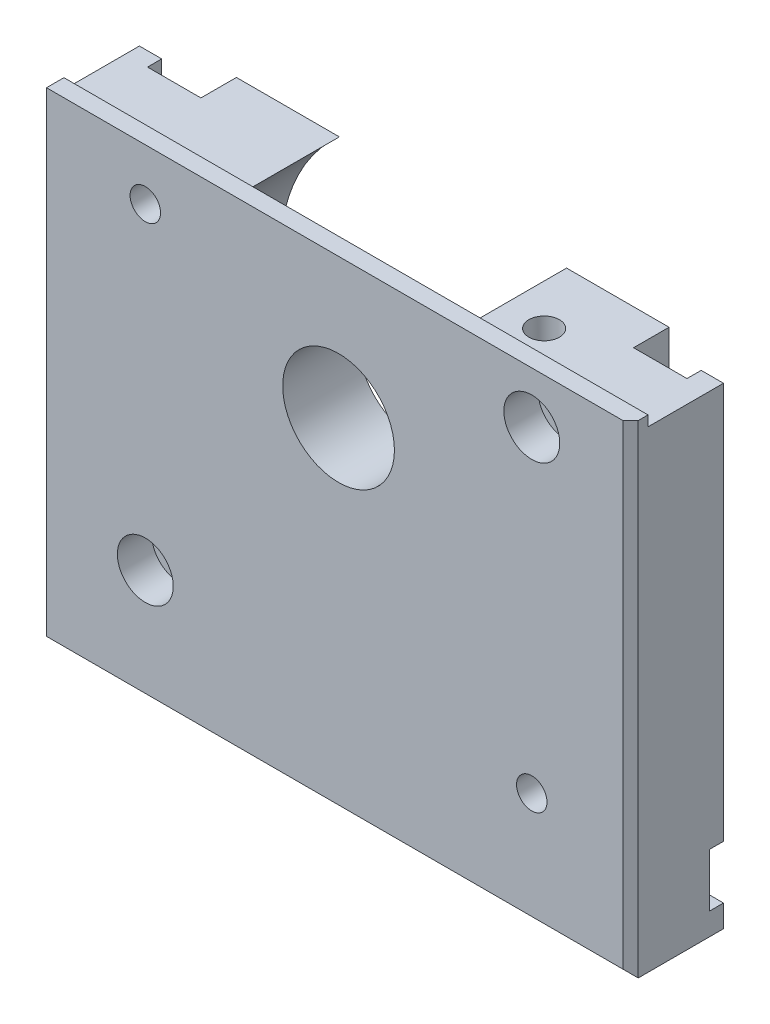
ISO-10303-21;
HEADER;
FILE_DESCRIPTION(('STEP AP214'),'2;1');
FILE_NAME('part.step','',(''),(''),'','','');
FILE_SCHEMA(('AUTOMOTIVE_DESIGN { 1 0 10303 214 1 1 1 1 }'));
ENDSEC;
DATA;
#1=APPLICATION_CONTEXT('core data for automotive mechanical design processes');
#2=APPLICATION_PROTOCOL_DEFINITION('international standard','automotive_design',2000,#1);
#3=PRODUCT_CONTEXT('',#1,'mechanical');
#4=PRODUCT('Part','Part','',(#3));
#5=PRODUCT_RELATED_PRODUCT_CATEGORY('part','',(#4));
#6=PRODUCT_DEFINITION_FORMATION('','',#4);
#7=PRODUCT_DEFINITION_CONTEXT('part definition',#1,'design');
#8=PRODUCT_DEFINITION('design','',#6,#7);
#9=PRODUCT_DEFINITION_SHAPE('','',#8);
#10=(LENGTH_UNIT() NAMED_UNIT(*) SI_UNIT(.MILLI.,.METRE.));
#11=(NAMED_UNIT(*) PLANE_ANGLE_UNIT() SI_UNIT($,.RADIAN.));
#12=(NAMED_UNIT(*) SI_UNIT($,.STERADIAN.) SOLID_ANGLE_UNIT());
#13=UNCERTAINTY_MEASURE_WITH_UNIT(LENGTH_MEASURE(1.E-05),#10,'distance_accuracy_value','');
#14=(GEOMETRIC_REPRESENTATION_CONTEXT(3) GLOBAL_UNCERTAINTY_ASSIGNED_CONTEXT((#13)) GLOBAL_UNIT_ASSIGNED_CONTEXT((#10,
#11,#12)) REPRESENTATION_CONTEXT('',''));
#15=CARTESIAN_POINT('',(0.,0.,0.));
#16=DIRECTION('',(0.,0.,1.));
#17=DIRECTION('',(1.,0.,0.));
#18=AXIS2_PLACEMENT_3D('',#15,#16,#17);
#19=CARTESIAN_POINT('',(42.5902,-63.0918,4.191));
#20=DIRECTION('',(0.,-1.,0.));
#21=DIRECTION('',(0.,0.,-1.));
#22=AXIS2_PLACEMENT_3D('',#19,#20,#21);
#23=PLANE('',#22);
#24=DIRECTION('',(0.,0.,1.));
#25=VECTOR('',#24,1.);
#26=CARTESIAN_POINT('',(42.5902,-63.0918,4.191));
#27=LINE('',#26,#25);
#28=CARTESIAN_POINT('',(42.5902,-63.0918,6.985));
#29=VERTEX_POINT('',#28);
#30=CARTESIAN_POINT('',(42.5902,-63.0918,4.191));
#31=VERTEX_POINT('',#30);
#32=EDGE_CURVE('E353',#29,#31,#27,.F.);
#33=ORIENTED_EDGE('',*,*,#32,.T.);
#34=DIRECTION('',(1.,0.,0.));
#35=VECTOR('',#34,1.);
#36=CARTESIAN_POINT('',(-1.15430872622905,-63.0918,4.191));
#37=LINE('',#36,#35);
#38=CARTESIAN_POINT('',(-42.5902,-63.0918,4.191));
#39=VERTEX_POINT('',#38);
#40=EDGE_CURVE('E357',#31,#39,#37,.F.);
#41=ORIENTED_EDGE('',*,*,#40,.T.);
#42=DIRECTION('',(0.,0.,-1.));
#43=VECTOR('',#42,1.);
#44=CARTESIAN_POINT('',(-42.5902,-63.0918,4.191));
#45=LINE('',#44,#43);
#46=CARTESIAN_POINT('',(-42.5902,-63.0918,6.985));
#47=VERTEX_POINT('',#46);
#48=EDGE_CURVE('E359',#39,#47,#45,.F.);
#49=ORIENTED_EDGE('',*,*,#48,.T.);
#50=DIRECTION('',(1.,0.,0.));
#51=VECTOR('',#50,1.);
#52=CARTESIAN_POINT('',(0.930085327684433,-63.0918,6.985));
#53=LINE('',#52,#51);
#54=EDGE_CURVE('E344',#47,#29,#53,.T.);
#55=ORIENTED_EDGE('',*,*,#54,.T.);
#56=EDGE_LOOP('',(#33,#41,#49,#55));
#57=FACE_BOUND('',#56,.T.);
#58=ADVANCED_FACE('F16',(#57),#23,.F.);
#59=CARTESIAN_POINT('',(53.1058,25.5288,4.191));
#60=DIRECTION('',(1.,0.,0.));
#61=DIRECTION('',(0.,0.,-1.));
#62=AXIS2_PLACEMENT_3D('',#59,#60,#61);
#63=PLANE('',#62);
#64=DIRECTION('',(0.,0.,-1.));
#65=VECTOR('',#64,1.);
#66=CARTESIAN_POINT('',(53.1058,25.5288,0.));
#67=LINE('',#66,#65);
#68=CARTESIAN_POINT('',(53.1058,25.5288,6.985));
#69=VERTEX_POINT('',#68);
#70=CARTESIAN_POINT('',(53.1058,25.5288,4.191));
#71=VERTEX_POINT('',#70);
#72=EDGE_CURVE('E431',#69,#71,#67,.T.);
#73=ORIENTED_EDGE('',*,*,#72,.T.);
#74=DIRECTION('',(0.,1.,0.));
#75=VECTOR('',#74,1.);
#76=CARTESIAN_POINT('',(53.1058,-29.0260440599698,4.191));
#77=LINE('',#76,#75);
#78=CARTESIAN_POINT('',(53.1058,-52.5762,4.191));
#79=VERTEX_POINT('',#78);
#80=EDGE_CURVE('E396',#71,#79,#77,.F.);
#81=ORIENTED_EDGE('',*,*,#80,.T.);
#82=DIRECTION('',(0.,0.,1.));
#83=VECTOR('',#82,1.);
#84=CARTESIAN_POINT('',(53.1058,-52.5762,4.191));
#85=LINE('',#84,#83);
#86=CARTESIAN_POINT('',(53.1058,-52.5762,6.985));
#87=VERTEX_POINT('',#86);
#88=EDGE_CURVE('E433',#79,#87,#85,.T.);
#89=ORIENTED_EDGE('',*,*,#88,.T.);
#90=DIRECTION('',(0.,1.,0.));
#91=VECTOR('',#90,1.);
#92=CARTESIAN_POINT('',(53.1058,-31.1622750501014,6.985));
#93=LINE('',#92,#91);
#94=EDGE_CURVE('E406',#87,#69,#93,.T.);
#95=ORIENTED_EDGE('',*,*,#94,.T.);
#96=EDGE_LOOP('',(#73,#81,#89,#95));
#97=FACE_BOUND('',#96,.T.);
#98=ADVANCED_FACE('F578',(#97),#63,.F.);
#99=CARTESIAN_POINT('',(30.5,25.5288,12.5));
#100=DIRECTION('',(0.,-1.,0.));
#101=DIRECTION('',(0.,0.,-1.));
#102=AXIS2_PLACEMENT_3D('',#99,#100,#101);
#103=CYLINDRICAL_SURFACE('',#102,3.);
#104=CARTESIAN_POINT('',(30.5,25.5288,12.5));
#105=DIRECTION('',(0.,-1.,0.));
#106=DIRECTION('',(0.,0.,-1.));
#107=AXIS2_PLACEMENT_3D('',#104,#105,#106);
#108=CIRCLE('',#107,3.);
#109=CARTESIAN_POINT('',(30.5,25.5288,9.5));
#110=VERTEX_POINT('',#109);
#111=EDGE_CURVE('E261',#110,#110,#108,.F.);
#112=ORIENTED_EDGE('',*,*,#111,.T.);
#113=EDGE_LOOP('',(#112));
#114=FACE_BOUND('',#113,.T.);
#115=CARTESIAN_POINT('',(27.5,20.0696856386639,12.5));
#116=CARTESIAN_POINT('',(27.4999984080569,20.0696876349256,12.3789862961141));
#117=CARTESIAN_POINT('',(27.5073959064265,20.0598849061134,12.2579801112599));
#118=CARTESIAN_POINT('',(27.5361275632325,20.0216892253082,12.0206410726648));
#119=CARTESIAN_POINT('',(27.5574741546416,19.9932796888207,11.9043124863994));
#120=CARTESIAN_POINT('',(27.6117175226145,19.9207280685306,11.6808819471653));
#121=CARTESIAN_POINT('',(27.6445110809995,19.8767265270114,11.5737078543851));
#122=CARTESIAN_POINT('',(27.7191783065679,19.7759087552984,11.3691089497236));
#123=CARTESIAN_POINT('',(27.7610561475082,19.71908663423,11.2716886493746));
#124=CARTESIAN_POINT('',(27.8742272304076,19.5643865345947,11.0408455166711));
#125=CARTESIAN_POINT('',(27.9497605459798,19.4601838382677,10.9137674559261));
#126=CARTESIAN_POINT('',(28.110089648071,19.2360620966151,10.6811010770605));
#127=CARTESIAN_POINT('',(28.1949092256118,19.11610251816,10.5755700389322));
#128=CARTESIAN_POINT('',(28.3533568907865,18.8887918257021,10.4016613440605));
#129=CARTESIAN_POINT('',(28.4261143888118,18.7832736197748,10.3300260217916));
#130=CARTESIAN_POINT('',(28.5736672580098,18.5666835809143,10.1980333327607));
#131=CARTESIAN_POINT('',(28.6484638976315,18.4556082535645,10.1376831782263));
#132=CARTESIAN_POINT('',(28.7990848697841,18.2291075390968,10.0270205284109));
#133=CARTESIAN_POINT('',(28.8749101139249,18.1136781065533,9.97671765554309));
#134=CARTESIAN_POINT('',(29.0268090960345,17.8794328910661,9.88512546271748));
#135=CARTESIAN_POINT('',(29.1028829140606,17.7606158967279,9.84383941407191));
#136=CARTESIAN_POINT('',(29.3138554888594,17.4266956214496,9.74033764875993));
#137=CARTESIAN_POINT('',(29.4484320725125,17.2086616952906,9.6868587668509));
#138=CARTESIAN_POINT('',(29.7146412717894,16.7666454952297,9.60125008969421));
#139=CARTESIAN_POINT('',(29.8462715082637,16.5426587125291,9.56913698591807));
#140=CARTESIAN_POINT('',(30.1058077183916,16.0897273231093,9.52308321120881));
#141=CARTESIAN_POINT('',(30.2336994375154,15.8607683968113,9.50920497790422));
#142=CARTESIAN_POINT('',(30.4845320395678,15.3998663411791,9.49741479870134));
#143=CARTESIAN_POINT('',(30.6074740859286,15.1679239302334,9.49949907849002));
#144=CARTESIAN_POINT('',(30.8266220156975,14.7432782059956,9.51618612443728));
#145=CARTESIAN_POINT('',(30.9236971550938,14.550925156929,9.52849886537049));
#146=CARTESIAN_POINT('',(31.1140777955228,14.165096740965,9.56193066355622));
#147=CARTESIAN_POINT('',(31.2073828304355,13.9716212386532,9.58305080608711));
#148=CARTESIAN_POINT('',(31.3901799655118,13.5837340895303,9.63354248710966));
#149=CARTESIAN_POINT('',(31.4796684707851,13.3893217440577,9.66292161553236));
#150=CARTESIAN_POINT('',(31.654657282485,13.0000629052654,9.72952512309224));
#151=CARTESIAN_POINT('',(31.7401578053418,12.8052164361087,9.76674907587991));
#152=CARTESIAN_POINT('',(31.9068182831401,12.4160900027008,9.84868801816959));
#153=CARTESIAN_POINT('',(31.9879925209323,12.2218104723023,9.89337604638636));
#154=CARTESIAN_POINT('',(32.1462675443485,11.8334849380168,9.99033488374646));
#155=CARTESIAN_POINT('',(32.2233683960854,11.6394389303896,10.0426055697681));
#156=CARTESIAN_POINT('',(32.3733541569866,11.2522185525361,10.1549380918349));
#157=CARTESIAN_POINT('',(32.4462433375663,11.0590434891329,10.2149918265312));
#158=CARTESIAN_POINT('',(32.5877867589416,10.6739848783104,10.343544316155));
#159=CARTESIAN_POINT('',(32.6564420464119,10.482101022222,10.4120409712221));
#160=CARTESIAN_POINT('',(32.7546854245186,10.2000779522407,10.5204484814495));
#161=CARTESIAN_POINT('',(32.7859683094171,10.1090855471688,10.5566289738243));
#162=CARTESIAN_POINT('',(32.8475021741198,9.92775155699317,10.6314225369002));
#163=CARTESIAN_POINT('',(32.8777531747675,9.83740995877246,10.6700355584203));
#164=CARTESIAN_POINT('',(32.9372340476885,9.65742084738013,10.7500345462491));
#165=CARTESIAN_POINT('',(32.9664621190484,9.56777475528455,10.7914250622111));
#166=CARTESIAN_POINT('',(33.023783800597,9.38961109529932,10.8772920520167));
#167=CARTESIAN_POINT('',(33.0518775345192,9.3010934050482,10.921768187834));
#168=CARTESIAN_POINT('',(33.107270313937,9.124221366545,11.0150318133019));
#169=CARTESIAN_POINT('',(33.1345505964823,9.03589028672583,11.0638749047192));
#170=CARTESIAN_POINT('',(33.1877139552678,8.8614165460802,11.1660167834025));
#171=CARTESIAN_POINT('',(33.2135973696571,8.77527335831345,11.2193144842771));
#172=CARTESIAN_POINT('',(33.2637121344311,8.60625706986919,11.3313834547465));
#173=CARTESIAN_POINT('',(33.2879455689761,8.52337990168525,11.3901475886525));
#174=CARTESIAN_POINT('',(33.3343705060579,8.36256113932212,11.5147242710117));
#175=CARTESIAN_POINT('',(33.3565650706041,8.28461220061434,11.5805259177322));
#176=CARTESIAN_POINT('',(33.3949820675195,8.14808950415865,11.7107229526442));
#177=CARTESIAN_POINT('',(33.4115984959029,8.08837707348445,11.7737888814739));
#178=CARTESIAN_POINT('',(33.4418918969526,7.97855779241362,11.9083907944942));
#179=CARTESIAN_POINT('',(33.4555815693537,7.92840954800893,11.9798880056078));
#180=CARTESIAN_POINT('',(33.4734215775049,7.86265082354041,12.0992003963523));
#181=CARTESIAN_POINT('',(33.4791257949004,7.84152603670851,12.1437027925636));
#182=CARTESIAN_POINT('',(33.4886772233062,7.80606374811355,12.235549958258));
#183=CARTESIAN_POINT('',(33.4925264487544,7.79171888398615,12.2828915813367));
#184=CARTESIAN_POINT('',(33.4979967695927,7.77131057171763,12.3800154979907));
#185=CARTESIAN_POINT('',(33.4995951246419,7.76533164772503,12.4298175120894));
#186=CARTESIAN_POINT('',(33.5002681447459,7.76281575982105,12.529676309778));
#187=CARTESIAN_POINT('',(33.4993435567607,7.76627600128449,12.5797330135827));
#188=CARTESIAN_POINT('',(33.4953477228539,7.78119587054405,12.6726655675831));
#189=CARTESIAN_POINT('',(33.4925312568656,7.79170588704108,12.7157129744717));
#190=CARTESIAN_POINT('',(33.4852866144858,7.81866130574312,12.7997416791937));
#191=CARTESIAN_POINT('',(33.480857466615,7.83511028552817,12.8407217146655));
#192=CARTESIAN_POINT('',(33.4672077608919,7.88561150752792,12.9474917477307));
#193=CARTESIAN_POINT('',(33.4567830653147,7.92400482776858,13.0110548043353));
#194=CARTESIAN_POINT('',(33.4334063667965,8.00939152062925,13.1316037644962));
#195=CARTESIAN_POINT('',(33.4204454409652,8.05641521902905,13.1885652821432));
#196=CARTESIAN_POINT('',(33.3889119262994,8.16979151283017,13.311971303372));
#197=CARTESIAN_POINT('',(33.3697809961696,8.23788323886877,13.3766494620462));
#198=CARTESIAN_POINT('',(33.3294841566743,8.37954483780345,13.4990841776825));
#199=CARTESIAN_POINT('',(33.3083143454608,8.45312515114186,13.5568269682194));
#200=CARTESIAN_POINT('',(33.2643004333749,8.60417880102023,13.6671254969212));
#201=CARTESIAN_POINT('',(33.2414481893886,8.68167041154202,13.7196526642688));
#202=CARTESIAN_POINT('',(33.1944520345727,8.83899778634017,13.8202270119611));
#203=CARTESIAN_POINT('',(33.170309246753,8.91883148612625,13.8682779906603));
#204=CARTESIAN_POINT('',(33.1063612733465,9.12758318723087,13.9878925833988));
#205=CARTESIAN_POINT('',(33.0656806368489,9.25780714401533,14.056702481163));
#206=CARTESIAN_POINT('',(32.9817697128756,9.52097826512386,14.1872526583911));
#207=CARTESIAN_POINT('',(32.9385381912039,9.65392672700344,14.248989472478));
#208=CARTESIAN_POINT('',(32.8496511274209,9.92183347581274,14.3667045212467));
#209=CARTESIAN_POINT('',(32.8039915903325,10.0567947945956,14.4226727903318));
#210=CARTESIAN_POINT('',(32.7104234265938,10.3279489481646,14.5295489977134));
#211=CARTESIAN_POINT('',(32.6625144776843,10.4641419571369,14.5804562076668));
#212=CARTESIAN_POINT('',(32.5644562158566,10.7375453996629,14.6777968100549));
#213=CARTESIAN_POINT('',(32.5143039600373,10.8747569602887,14.7242240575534));
#214=CARTESIAN_POINT('',(32.4118641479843,11.1497458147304,14.8128679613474));
#215=CARTESIAN_POINT('',(32.3595764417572,11.2875231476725,14.8550843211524));
#216=CARTESIAN_POINT('',(32.1996727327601,11.7010902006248,14.9756736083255));
#217=CARTESIAN_POINT('',(32.0889066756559,11.9774207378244,15.0480940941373));
#218=CARTESIAN_POINT('',(31.8469537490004,12.5596438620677,15.1845837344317));
#219=CARTESIAN_POINT('',(31.7148480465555,12.8655538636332,15.2469447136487));
#220=CARTESIAN_POINT('',(31.4407490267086,13.4764673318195,15.3524660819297));
#221=CARTESIAN_POINT('',(31.2987508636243,13.7814702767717,15.3956169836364));
#222=CARTESIAN_POINT('',(31.005970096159,14.3877138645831,15.460807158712));
#223=CARTESIAN_POINT('',(30.8552333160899,14.6889655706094,15.4829475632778));
#224=CARTESIAN_POINT('',(30.5450138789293,15.2876064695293,15.5036877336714));
#225=CARTESIAN_POINT('',(30.3855373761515,15.5849982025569,15.5023038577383));
#226=CARTESIAN_POINT('',(30.0850090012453,16.1269280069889,15.4743486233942));
#227=CARTESIAN_POINT('',(29.9450971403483,16.3723024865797,15.451846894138));
#228=CARTESIAN_POINT('',(29.6603749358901,16.858274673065,15.3838443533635));
#229=CARTESIAN_POINT('',(29.5155497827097,17.0988536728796,15.3382669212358));
#230=CARTESIAN_POINT('',(29.2752351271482,17.4878164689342,15.2404894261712));
#231=CARTESIAN_POINT('',(29.1804456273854,17.6386655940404,15.1963569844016));
#232=CARTESIAN_POINT('',(28.9906206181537,17.9359011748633,15.094874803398));
#233=CARTESIAN_POINT('',(28.8955850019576,18.0822851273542,15.0375177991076));
#234=CARTESIAN_POINT('',(28.7070435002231,18.3682291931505,14.9079717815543));
#235=CARTESIAN_POINT('',(28.613532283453,18.5078203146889,14.8358599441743));
#236=CARTESIAN_POINT('',(28.4294902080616,18.778591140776,14.6743871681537));
#237=CARTESIAN_POINT('',(28.3389549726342,18.9097834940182,14.5850530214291));
#238=CARTESIAN_POINT('',(28.1826095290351,19.1333622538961,14.4079968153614));
#239=CARTESIAN_POINT('',(28.1156926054,19.2279975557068,14.3241198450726));
#240=CARTESIAN_POINT('',(27.9873300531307,19.4078306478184,14.1428114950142));
#241=CARTESIAN_POINT('',(27.925886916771,19.4930241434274,14.0453739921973));
#242=CARTESIAN_POINT('',(27.8107053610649,19.6514462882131,13.8349976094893));
#243=CARTESIAN_POINT('',(27.7570530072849,19.7245423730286,13.7219091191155));
#244=CARTESIAN_POINT('',(27.6621046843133,19.8530957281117,13.4813156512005));
#245=CARTESIAN_POINT('',(27.6207892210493,19.908580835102,13.3538338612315));
#246=CARTESIAN_POINT('',(27.5595876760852,19.9904635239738,13.1064356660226));
#247=CARTESIAN_POINT('',(27.5374626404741,20.0199127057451,12.9881036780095));
#248=CARTESIAN_POINT('',(27.5076783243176,20.0595111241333,12.7465077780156));
#249=CARTESIAN_POINT('',(27.5000016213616,20.0696836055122,12.6232499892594));
#250=CARTESIAN_POINT('',(27.5,20.0696856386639,12.5));
#251=B_SPLINE_CURVE_WITH_KNOTS('',3,(#115,#116,#117,#118,#119,#120,#121,#122,#123,#124,#125,
#126,#127,#128,#129,#130,#131,#132,#133,#134,#135,#136,#137,#138,#139,#140,#141,#142,#143,#144,
#145,#146,#147,#148,#149,#150,#151,#152,#153,#154,#155,#156,#157,#158,#159,#160,#161,#162,#163,
#164,#165,#166,#167,#168,#169,#170,#171,#172,#173,#174,#175,#176,#177,#178,#179,#180,#181,#182,
#183,#184,#185,#186,#187,#188,#189,#190,#191,#192,#193,#194,#195,#196,#197,#198,#199,#200,#201,
#202,#203,#204,#205,#206,#207,#208,#209,#210,#211,#212,#213,#214,#215,#216,#217,#218,#219,#220,
#221,#222,#223,#224,#225,#226,#227,#228,#229,#230,#231,#232,#233,#234,#235,#236,#237,#238,#239,
#240,#241,#242,#243,#244,#245,#246,#247,#248,#249,#250),.UNSPECIFIED.,.T.,.F.,(4,2,2,2,2,2,2,2,
2,2,2,2,2,2,2,2,2,2,2,2,2,2,2,2,2,2,2,2,2,2,2,2,2,2,2,2,2,2,2,2,2,2,2,2,2,2,2,2,2,2,2,2,2,2,2,2,
2,2,2,2,2,2,2,2,2,2,2,4),(0.,0.362445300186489,0.725214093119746,1.08479284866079,
1.44453716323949,1.9841006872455,2.52508041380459,2.96496699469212,3.4051337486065,
3.84572005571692,4.28646594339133,5.07042058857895,5.85498696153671,6.64223281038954,
7.42929252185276,8.0765110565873,8.72380936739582,9.3717044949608,10.0195644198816,
10.6651328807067,11.310690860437,11.9555821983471,12.6003134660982,12.9086767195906,
13.2170337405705,13.5259088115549,13.8347500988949,14.1483218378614,14.4618173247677,
14.774909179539,15.0875228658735,15.3522355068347,15.615775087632,15.7640930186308,
15.9122495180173,16.0618923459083,16.2114908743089,16.3441592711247,16.476907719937,
16.7005587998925,16.9250113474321,17.2118657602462,17.4992804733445,17.7881915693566,
18.0768552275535,18.5349535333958,18.9932753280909,19.4523760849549,19.9115428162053,
20.3713306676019,20.8311508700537,21.7497667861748,22.7661127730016,23.7829601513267,
24.7948878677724,25.8061119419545,26.6553742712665,27.5074751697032,28.0576776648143,
28.6081831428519,29.1558795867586,29.7027307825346,30.1310882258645,30.5596397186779,
30.9926142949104,31.4249010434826,31.7944901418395,32.1636332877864),.UNSPECIFIED.);
#252=CARTESIAN_POINT('',(27.5,20.0696856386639,12.5));
#253=VERTEX_POINT('',#252);
#254=EDGE_CURVE('E260',#253,#253,#251,.T.);
#255=ORIENTED_EDGE('',*,*,#254,.T.);
#256=EDGE_LOOP('',(#255));
#257=FACE_BOUND('',#256,.T.);
#258=ADVANCED_FACE('F500',(#114,#257),#103,.F.);
#259=CARTESIAN_POINT('',(0.,0.,18.55));
#260=DIRECTION('',(0.,0.,1.));
#261=DIRECTION('',(1.,0.,0.));
#262=AXIS2_PLACEMENT_3D('',#259,#260,#261);
#263=PLANE('',#262);
#264=CARTESIAN_POINT('',(0.,0.,18.55));
#265=DIRECTION('',(0.,0.,-1.));
#266=DIRECTION('',(-1.,0.,0.));
#267=AXIS2_PLACEMENT_3D('',#264,#265,#266);
#268=CIRCLE('',#267,12.5);
#269=CARTESIAN_POINT('',(-12.5,0.,18.55));
#270=VERTEX_POINT('',#269);
#271=EDGE_CURVE('E377',#270,#270,#268,.T.);
#272=ORIENTED_EDGE('',*,*,#271,.F.);
#273=EDGE_LOOP('',(#272));
#274=FACE_BOUND('',#273,.T.);
#275=CARTESIAN_POINT('',(0.,0.,18.55));
#276=DIRECTION('',(0.,0.,-1.));
#277=DIRECTION('',(-1.,0.,0.));
#278=AXIS2_PLACEMENT_3D('',#275,#276,#277);
#279=CIRCLE('',#278,15.);
#280=CARTESIAN_POINT('',(-15.,0.,18.55));
#281=VERTEX_POINT('',#280);
#282=EDGE_CURVE('E20',#281,#281,#279,.F.);
#283=ORIENTED_EDGE('',*,*,#282,.F.);
#284=EDGE_LOOP('',(#283));
#285=FACE_BOUND('',#284,.T.);
#286=ADVANCED_FACE('F573',(#274,#285),#263,.F.);
#287=CARTESIAN_POINT('',(57.5,-63.0918,4.191));
#288=DIRECTION('',(0.,-1.,0.));
#289=DIRECTION('',(0.,0.,-1.));
#290=AXIS2_PLACEMENT_3D('',#287,#288,#289);
#291=PLANE('',#290);
#292=DIRECTION('',(0.,0.,-1.));
#293=VECTOR('',#292,1.);
#294=CARTESIAN_POINT('',(57.5,-63.0918,0.));
#295=LINE('',#294,#293);
#296=CARTESIAN_POINT('',(57.5,-63.0918,4.191));
#297=VERTEX_POINT('',#296);
#298=CARTESIAN_POINT('',(57.5,-63.0918,6.985));
#299=VERTEX_POINT('',#298);
#300=EDGE_CURVE('E402',#297,#299,#295,.F.);
#301=ORIENTED_EDGE('',*,*,#300,.F.);
#302=DIRECTION('',(1.,0.,0.));
#303=VECTOR('',#302,1.);
#304=CARTESIAN_POINT('',(-1.15430872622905,-63.0918,4.191));
#305=LINE('',#304,#303);
#306=CARTESIAN_POINT('',(53.1058,-63.0918,4.191));
#307=VERTEX_POINT('',#306);
#308=EDGE_CURVE('E413',#297,#307,#305,.F.);
#309=ORIENTED_EDGE('',*,*,#308,.T.);
#310=DIRECTION('',(0.,0.,-1.));
#311=VECTOR('',#310,1.);
#312=CARTESIAN_POINT('',(53.1058,-63.0918,4.191));
#313=LINE('',#312,#311);
#314=CARTESIAN_POINT('',(53.1058,-63.0918,6.985));
#315=VERTEX_POINT('',#314);
#316=EDGE_CURVE('E436',#307,#315,#313,.F.);
#317=ORIENTED_EDGE('',*,*,#316,.T.);
#318=DIRECTION('',(1.,0.,0.));
#319=VECTOR('',#318,1.);
#320=CARTESIAN_POINT('',(0.930085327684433,-63.0918,6.985));
#321=LINE('',#320,#319);
#322=EDGE_CURVE('E343',#315,#299,#321,.T.);
#323=ORIENTED_EDGE('',*,*,#322,.T.);
#324=EDGE_LOOP('',(#301,#309,#317,#323));
#325=FACE_BOUND('',#324,.T.);
#326=ADVANCED_FACE('F569',(#325),#291,.F.);
#327=CARTESIAN_POINT('',(53.1058,-52.5762,4.191));
#328=DIRECTION('',(0.,1.,0.));
#329=DIRECTION('',(0.,0.,1.));
#330=AXIS2_PLACEMENT_3D('',#327,#328,#329);
#331=PLANE('',#330);
#332=ORIENTED_EDGE('',*,*,#88,.F.);
#333=DIRECTION('',(1.,0.,0.));
#334=VECTOR('',#333,1.);
#335=CARTESIAN_POINT('',(-1.15430872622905,-52.5762,4.191));
#336=LINE('',#335,#334);
#337=CARTESIAN_POINT('',(57.5,-52.5762,4.191));
#338=VERTEX_POINT('',#337);
#339=EDGE_CURVE('E383',#79,#338,#336,.T.);
#340=ORIENTED_EDGE('',*,*,#339,.T.);
#341=DIRECTION('',(0.,0.,-1.));
#342=VECTOR('',#341,1.);
#343=CARTESIAN_POINT('',(57.5,-52.5762,0.));
#344=LINE('',#343,#342);
#345=CARTESIAN_POINT('',(57.5,-52.5762,6.985));
#346=VERTEX_POINT('',#345);
#347=EDGE_CURVE('E394',#346,#338,#344,.T.);
#348=ORIENTED_EDGE('',*,*,#347,.F.);
#349=DIRECTION('',(1.,0.,0.));
#350=VECTOR('',#349,1.);
#351=CARTESIAN_POINT('',(0.930085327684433,-52.5762,6.985));
#352=LINE('',#351,#350);
#353=EDGE_CURVE('E403',#346,#87,#352,.F.);
#354=ORIENTED_EDGE('',*,*,#353,.T.);
#355=EDGE_LOOP('',(#332,#340,#348,#354));
#356=FACE_BOUND('',#355,.T.);
#357=ADVANCED_FACE('F565',(#356),#331,.F.);
#358=CARTESIAN_POINT('',(-1.15430872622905,-29.0260440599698,4.191));
#359=DIRECTION('',(0.,0.,1.));
#360=DIRECTION('',(1.,0.,0.));
#361=AXIS2_PLACEMENT_3D('',#358,#359,#360);
#362=PLANE('',#361);
#363=ORIENTED_EDGE('',*,*,#80,.F.);
#364=DIRECTION('',(1.,0.,0.));
#365=VECTOR('',#364,1.);
#366=CARTESIAN_POINT('',(57.5,25.5288,4.191));
#367=LINE('',#366,#365);
#368=CARTESIAN_POINT('',(57.5,25.5288,4.191));
#369=VERTEX_POINT('',#368);
#370=EDGE_CURVE('E327',#71,#369,#367,.T.);
#371=ORIENTED_EDGE('',*,*,#370,.T.);
#372=DIRECTION('',(0.,1.,0.));
#373=VECTOR('',#372,1.);
#374=CARTESIAN_POINT('',(57.5,27.5608,4.191));
#375=LINE('',#374,#373);
#376=EDGE_CURVE('E374',#338,#369,#375,.T.);
#377=ORIENTED_EDGE('',*,*,#376,.F.);
#378=ORIENTED_EDGE('',*,*,#339,.F.);
#379=EDGE_LOOP('',(#363,#371,#377,#378));
#380=FACE_BOUND('',#379,.T.);
#381=ADVANCED_FACE('F561',(#380),#362,.F.);
#382=CARTESIAN_POINT('',(0.930085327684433,-31.1622750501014,6.985));
#383=DIRECTION('',(0.,0.,1.));
#384=DIRECTION('',(1.,0.,0.));
#385=AXIS2_PLACEMENT_3D('',#382,#383,#384);
#386=PLANE('',#385);
#387=DIRECTION('',(0.,1.,0.));
#388=VECTOR('',#387,1.);
#389=CARTESIAN_POINT('',(-53.1058,-67.486,6.985));
#390=LINE('',#389,#388);
#391=CARTESIAN_POINT('',(-53.1058,-7.71980000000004,6.985));
#392=VERTEX_POINT('',#391);
#393=CARTESIAN_POINT('',(-53.1058,25.5288,6.985));
#394=VERTEX_POINT('',#393);
#395=EDGE_CURVE('E381',#392,#394,#390,.T.);
#396=ORIENTED_EDGE('',*,*,#395,.T.);
#397=DIRECTION('',(1.,0.,0.));
#398=VECTOR('',#397,1.);
#399=CARTESIAN_POINT('',(-22.3181686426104,25.5288,6.985));
#400=LINE('',#399,#398);
#401=CARTESIAN_POINT('',(-42.5902,25.5288,6.985));
#402=VERTEX_POINT('',#401);
#403=EDGE_CURVE('E294',#394,#402,#400,.T.);
#404=ORIENTED_EDGE('',*,*,#403,.T.);
#405=DIRECTION('',(0.,1.,0.));
#406=VECTOR('',#405,1.);
#407=CARTESIAN_POINT('',(-42.5902,32.2840717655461,6.985));
#408=LINE('',#407,#406);
#409=CARTESIAN_POINT('',(-42.5902,-7.71980000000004,6.985));
#410=VERTEX_POINT('',#409);
#411=EDGE_CURVE('E302',#402,#410,#408,.F.);
#412=ORIENTED_EDGE('',*,*,#411,.T.);
#413=DIRECTION('',(1.,0.,0.));
#414=VECTOR('',#413,1.);
#415=CARTESIAN_POINT('',(-57.5,-7.71980000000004,6.985));
#416=LINE('',#415,#414);
#417=EDGE_CURVE('E378',#410,#392,#416,.F.);
#418=ORIENTED_EDGE('',*,*,#417,.T.);
#419=EDGE_LOOP('',(#396,#404,#412,#418));
#420=FACE_BOUND('',#419,.T.);
#421=ADVANCED_FACE('F557',(#420),#386,.F.);
#422=CARTESIAN_POINT('',(-53.1058,-67.486,4.191));
#423=DIRECTION('',(-1.,0.,0.));
#424=DIRECTION('',(0.,0.,1.));
#425=AXIS2_PLACEMENT_3D('',#422,#423,#424);
#426=PLANE('',#425);
#427=DIRECTION('',(0.,1.,0.));
#428=VECTOR('',#427,1.);
#429=CARTESIAN_POINT('',(-53.1058,-29.0260440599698,4.191));
#430=LINE('',#429,#428);
#431=CARTESIAN_POINT('',(-53.1058,-7.71980000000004,4.191));
#432=VERTEX_POINT('',#431);
#433=CARTESIAN_POINT('',(-53.1057999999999,25.5288,4.191));
#434=VERTEX_POINT('',#433);
#435=EDGE_CURVE('E380',#432,#434,#430,.T.);
#436=ORIENTED_EDGE('',*,*,#435,.T.);
#437=DIRECTION('',(0.,0.,-1.));
#438=VECTOR('',#437,1.);
#439=CARTESIAN_POINT('',(-53.1057999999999,25.5288,0.));
#440=LINE('',#439,#438);
#441=EDGE_CURVE('E289',#434,#394,#440,.F.);
#442=ORIENTED_EDGE('',*,*,#441,.T.);
#443=ORIENTED_EDGE('',*,*,#395,.F.);
#444=DIRECTION('',(0.,0.,1.));
#445=VECTOR('',#444,1.);
#446=CARTESIAN_POINT('',(-53.1058,-7.71980000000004,0.));
#447=LINE('',#446,#445);
#448=EDGE_CURVE('E286',#392,#432,#447,.F.);
#449=ORIENTED_EDGE('',*,*,#448,.T.);
#450=EDGE_LOOP('',(#436,#442,#443,#449));
#451=FACE_BOUND('',#450,.T.);
#452=ADVANCED_FACE('F553',(#451),#426,.F.);
#453=CARTESIAN_POINT('',(0.,0.,19.05));
#454=DIRECTION('',(0.,0.,-1.));
#455=DIRECTION('',(-1.,0.,0.));
#456=AXIS2_PLACEMENT_3D('',#453,#454,#455);
#457=CYLINDRICAL_SURFACE('',#456,15.);
#458=CARTESIAN_POINT('',(0.,0.,19.05));
#459=DIRECTION('',(0.,0.,-1.));
#460=DIRECTION('',(-1.,0.,0.));
#461=AXIS2_PLACEMENT_3D('',#458,#459,#460);
#462=CIRCLE('',#461,15.);
#463=CARTESIAN_POINT('',(-15.,0.,19.05));
#464=VERTEX_POINT('',#463);
#465=EDGE_CURVE('E365',#464,#464,#462,.T.);
#466=ORIENTED_EDGE('',*,*,#465,.T.);
#467=EDGE_LOOP('',(#466));
#468=FACE_BOUND('',#467,.T.);
#469=ORIENTED_EDGE('',*,*,#282,.T.);
#470=EDGE_LOOP('',(#469));
#471=FACE_BOUND('',#470,.T.);
#472=ADVANCED_FACE('F549',(#468,#471),#457,.T.);
#473=CARTESIAN_POINT('',(-53.1058,-67.486,4.191));
#474=DIRECTION('',(-1.,0.,0.));
#475=DIRECTION('',(0.,0.,1.));
#476=AXIS2_PLACEMENT_3D('',#473,#474,#475);
#477=PLANE('',#476);
#478=DIRECTION('',(0.,1.,0.));
#479=VECTOR('',#478,1.);
#480=CARTESIAN_POINT('',(-53.1058,-31.1622750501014,6.985));
#481=LINE('',#480,#479);
#482=CARTESIAN_POINT('',(-53.1058,-46.2575071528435,6.985));
#483=VERTEX_POINT('',#482);
#484=CARTESIAN_POINT('',(-53.1058,-67.486,6.985));
#485=VERTEX_POINT('',#484);
#486=EDGE_CURVE('E349',#483,#485,#481,.F.);
#487=ORIENTED_EDGE('',*,*,#486,.T.);
#488=DIRECTION('',(0.,0.,-1.));
#489=VECTOR('',#488,1.);
#490=CARTESIAN_POINT('',(-53.1058,-67.486,0.));
#491=LINE('',#490,#489);
#492=CARTESIAN_POINT('',(-53.1058,-67.486,4.191));
#493=VERTEX_POINT('',#492);
#494=EDGE_CURVE('E738',#493,#485,#491,.F.);
#495=ORIENTED_EDGE('',*,*,#494,.F.);
#496=DIRECTION('',(0.,1.,0.));
#497=VECTOR('',#496,1.);
#498=CARTESIAN_POINT('',(-53.1058,-29.0260440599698,4.191));
#499=LINE('',#498,#497);
#500=CARTESIAN_POINT('',(-53.1058,-46.2575071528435,4.191));
#501=VERTEX_POINT('',#500);
#502=EDGE_CURVE('E744',#493,#501,#499,.T.);
#503=ORIENTED_EDGE('',*,*,#502,.T.);
#504=DIRECTION('',(0.,0.,1.));
#505=VECTOR('',#504,1.);
#506=CARTESIAN_POINT('',(-53.1058,-46.2575071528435,0.));
#507=LINE('',#506,#505);
#508=EDGE_CURVE('E362',#501,#483,#507,.T.);
#509=ORIENTED_EDGE('',*,*,#508,.T.);
#510=EDGE_LOOP('',(#487,#495,#503,#509));
#511=FACE_BOUND('',#510,.T.);
#512=ADVANCED_FACE('F545',(#511),#477,.F.);
#513=CARTESIAN_POINT('',(-42.5902,-63.0918,4.191));
#514=DIRECTION('',(1.,0.,0.));
#515=DIRECTION('',(0.,0.,-1.));
#516=AXIS2_PLACEMENT_3D('',#513,#514,#515);
#517=PLANE('',#516);
#518=ORIENTED_EDGE('',*,*,#48,.F.);
#519=DIRECTION('',(0.,1.,0.));
#520=VECTOR('',#519,1.);
#521=CARTESIAN_POINT('',(-42.5902,-29.0260440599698,4.191));
#522=LINE('',#521,#520);
#523=CARTESIAN_POINT('',(-42.5902,-67.486,4.191));
#524=VERTEX_POINT('',#523);
#525=EDGE_CURVE('E355',#39,#524,#522,.F.);
#526=ORIENTED_EDGE('',*,*,#525,.T.);
#527=DIRECTION('',(0.,0.,-1.));
#528=VECTOR('',#527,1.);
#529=CARTESIAN_POINT('',(-42.5902,-67.486,0.));
#530=LINE('',#529,#528);
#531=CARTESIAN_POINT('',(-42.5902,-67.486,6.985));
#532=VERTEX_POINT('',#531);
#533=EDGE_CURVE('E732',#532,#524,#530,.T.);
#534=ORIENTED_EDGE('',*,*,#533,.F.);
#535=DIRECTION('',(0.,1.,0.));
#536=VECTOR('',#535,1.);
#537=CARTESIAN_POINT('',(-42.5902,-31.1622750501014,6.985));
#538=LINE('',#537,#536);
#539=EDGE_CURVE('E346',#532,#47,#538,.T.);
#540=ORIENTED_EDGE('',*,*,#539,.T.);
#541=EDGE_LOOP('',(#518,#526,#534,#540));
#542=FACE_BOUND('',#541,.T.);
#543=ADVANCED_FACE('F541',(#542),#517,.F.);
#544=CARTESIAN_POINT('',(-1.15430872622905,-29.0260440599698,4.191));
#545=DIRECTION('',(0.,0.,1.));
#546=DIRECTION('',(1.,0.,0.));
#547=AXIS2_PLACEMENT_3D('',#544,#545,#546);
#548=PLANE('',#547);
#549=DIRECTION('',(1.,0.,0.));
#550=VECTOR('',#549,1.);
#551=CARTESIAN_POINT('',(57.5,-67.486,4.191));
#552=LINE('',#551,#550);
#553=CARTESIAN_POINT('',(42.5902,-67.486,4.191));
#554=VERTEX_POINT('',#553);
#555=EDGE_CURVE('E729',#524,#554,#552,.T.);
#556=ORIENTED_EDGE('',*,*,#555,.F.);
#557=ORIENTED_EDGE('',*,*,#525,.F.);
#558=ORIENTED_EDGE('',*,*,#40,.F.);
#559=DIRECTION('',(0.,1.,0.));
#560=VECTOR('',#559,1.);
#561=CARTESIAN_POINT('',(42.5902,-67.486,4.191));
#562=LINE('',#561,#560);
#563=EDGE_CURVE('E351',#31,#554,#562,.F.);
#564=ORIENTED_EDGE('',*,*,#563,.T.);
#565=EDGE_LOOP('',(#556,#557,#558,#564));
#566=FACE_BOUND('',#565,.T.);
#567=ADVANCED_FACE('F537',(#566),#548,.F.);
#568=CARTESIAN_POINT('',(42.5902,-67.486,4.191));
#569=DIRECTION('',(-1.,0.,0.));
#570=DIRECTION('',(0.,0.,1.));
#571=AXIS2_PLACEMENT_3D('',#568,#569,#570);
#572=PLANE('',#571);
#573=DIRECTION('',(0.,0.,-1.));
#574=VECTOR('',#573,1.);
#575=CARTESIAN_POINT('',(42.5902,-67.486,0.));
#576=LINE('',#575,#574);
#577=CARTESIAN_POINT('',(42.5902,-67.486,6.985));
#578=VERTEX_POINT('',#577);
#579=EDGE_CURVE('E726',#554,#578,#576,.F.);
#580=ORIENTED_EDGE('',*,*,#579,.F.);
#581=ORIENTED_EDGE('',*,*,#563,.F.);
#582=ORIENTED_EDGE('',*,*,#32,.F.);
#583=DIRECTION('',(0.,1.,0.));
#584=VECTOR('',#583,1.);
#585=CARTESIAN_POINT('',(42.5902,-31.1622750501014,6.985));
#586=LINE('',#585,#584);
#587=EDGE_CURVE('E341',#29,#578,#586,.F.);
#588=ORIENTED_EDGE('',*,*,#587,.T.);
#589=EDGE_LOOP('',(#580,#581,#582,#588));
#590=FACE_BOUND('',#589,.T.);
#591=ADVANCED_FACE('F533',(#590),#572,.F.);
#592=CARTESIAN_POINT('',(0.930085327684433,-31.1622750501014,6.985));
#593=DIRECTION('',(0.,0.,1.));
#594=DIRECTION('',(1.,0.,0.));
#595=AXIS2_PLACEMENT_3D('',#592,#593,#594);
#596=PLANE('',#595);
#597=DIRECTION('',(0.,1.,0.));
#598=VECTOR('',#597,1.);
#599=CARTESIAN_POINT('',(-42.5902,32.2840717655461,6.985));
#600=LINE('',#599,#598);
#601=CARTESIAN_POINT('',(-42.5902,-40.0109103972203,6.985));
#602=VERTEX_POINT('',#601);
#603=CARTESIAN_POINT('',(-42.5902,-52.5762,6.985));
#604=VERTEX_POINT('',#603);
#605=EDGE_CURVE('E313',#602,#604,#600,.F.);
#606=ORIENTED_EDGE('',*,*,#605,.T.);
#607=DIRECTION('',(1.,0.,0.));
#608=VECTOR('',#607,1.);
#609=CARTESIAN_POINT('',(-42.5902,-52.5762,6.985));
#610=LINE('',#609,#608);
#611=CARTESIAN_POINT('',(42.5902,-52.5762,6.985));
#612=VERTEX_POINT('',#611);
#613=EDGE_CURVE('E422',#604,#612,#610,.T.);
#614=ORIENTED_EDGE('',*,*,#613,.T.);
#615=DIRECTION('',(0.,1.,0.));
#616=VECTOR('',#615,1.);
#617=CARTESIAN_POINT('',(42.5902,-52.5762,6.985));
#618=LINE('',#617,#616);
#619=CARTESIAN_POINT('',(42.5902,25.5288,6.985));
#620=VERTEX_POINT('',#619);
#621=EDGE_CURVE('E334',#612,#620,#618,.T.);
#622=ORIENTED_EDGE('',*,*,#621,.T.);
#623=DIRECTION('',(1.,0.,0.));
#624=VECTOR('',#623,1.);
#625=CARTESIAN_POINT('',(57.5,25.5288,6.985));
#626=LINE('',#625,#624);
#627=EDGE_CURVE('E326',#620,#69,#626,.T.);
#628=ORIENTED_EDGE('',*,*,#627,.T.);
#629=ORIENTED_EDGE('',*,*,#94,.F.);
#630=ORIENTED_EDGE('',*,*,#353,.F.);
#631=DIRECTION('',(0.,1.,0.));
#632=VECTOR('',#631,1.);
#633=CARTESIAN_POINT('',(57.5,27.5608,6.985));
#634=LINE('',#633,#632);
#635=EDGE_CURVE('E399',#299,#346,#634,.T.);
#636=ORIENTED_EDGE('',*,*,#635,.F.);
#637=ORIENTED_EDGE('',*,*,#322,.F.);
#638=DIRECTION('',(0.,1.,0.));
#639=VECTOR('',#638,1.);
#640=CARTESIAN_POINT('',(53.1058,-63.0918,6.985));
#641=LINE('',#640,#639);
#642=CARTESIAN_POINT('',(53.1058,-67.486,6.985));
#643=VERTEX_POINT('',#642);
#644=EDGE_CURVE('E416',#315,#643,#641,.F.);
#645=ORIENTED_EDGE('',*,*,#644,.T.);
#646=DIRECTION('',(1.,0.,0.));
#647=VECTOR('',#646,1.);
#648=CARTESIAN_POINT('',(57.5,-67.486,6.985));
#649=LINE('',#648,#647);
#650=EDGE_CURVE('E723',#578,#643,#649,.T.);
#651=ORIENTED_EDGE('',*,*,#650,.F.);
#652=ORIENTED_EDGE('',*,*,#587,.F.);
#653=ORIENTED_EDGE('',*,*,#54,.F.);
#654=ORIENTED_EDGE('',*,*,#539,.F.);
#655=DIRECTION('',(1.,0.,0.));
#656=VECTOR('',#655,1.);
#657=CARTESIAN_POINT('',(57.5,-67.486,6.985));
#658=LINE('',#657,#656);
#659=EDGE_CURVE('E735',#485,#532,#658,.T.);
#660=ORIENTED_EDGE('',*,*,#659,.F.);
#661=ORIENTED_EDGE('',*,*,#486,.F.);
#662=DIRECTION('',(0.859748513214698,0.51071762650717,0.));
#663=VECTOR('',#662,1.);
#664=CARTESIAN_POINT('',(-38.0448,-37.3108,6.985));
#665=LINE('',#664,#663);
#666=EDGE_CURVE('E425',#483,#602,#665,.T.);
#667=ORIENTED_EDGE('',*,*,#666,.T.);
#668=EDGE_LOOP('',(#606,#614,#622,#628,#629,#630,#636,#637,#645,#651,#652,#653,#654,#660,#661,#667));
#669=FACE_BOUND('',#668,.T.);
#670=ADVANCED_FACE('F529',(#669),#596,.F.);
#671=CARTESIAN_POINT('',(53.1058,-63.0918,4.191));
#672=DIRECTION('',(1.,0.,0.));
#673=DIRECTION('',(0.,0.,-1.));
#674=AXIS2_PLACEMENT_3D('',#671,#672,#673);
#675=PLANE('',#674);
#676=ORIENTED_EDGE('',*,*,#316,.F.);
#677=DIRECTION('',(0.,1.,0.));
#678=VECTOR('',#677,1.);
#679=CARTESIAN_POINT('',(53.1058,-29.0260440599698,4.191));
#680=LINE('',#679,#678);
#681=CARTESIAN_POINT('',(53.1058,-67.486,4.191));
#682=VERTEX_POINT('',#681);
#683=EDGE_CURVE('E415',#307,#682,#680,.F.);
#684=ORIENTED_EDGE('',*,*,#683,.T.);
#685=DIRECTION('',(0.,0.,-1.));
#686=VECTOR('',#685,1.);
#687=CARTESIAN_POINT('',(53.1058,-67.486,0.));
#688=LINE('',#687,#686);
#689=EDGE_CURVE('E421',#643,#682,#688,.T.);
#690=ORIENTED_EDGE('',*,*,#689,.F.);
#691=ORIENTED_EDGE('',*,*,#644,.F.);
#692=EDGE_LOOP('',(#676,#684,#690,#691));
#693=FACE_BOUND('',#692,.T.);
#694=ADVANCED_FACE('F525',(#693),#675,.F.);
#695=CARTESIAN_POINT('',(-1.15430872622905,-29.0260440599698,4.191));
#696=DIRECTION('',(0.,0.,1.));
#697=DIRECTION('',(1.,0.,0.));
#698=AXIS2_PLACEMENT_3D('',#695,#696,#697);
#699=PLANE('',#698);
#700=ORIENTED_EDGE('',*,*,#308,.F.);
#701=DIRECTION('',(0.,1.,0.));
#702=VECTOR('',#701,1.);
#703=CARTESIAN_POINT('',(57.5,27.5608,4.191));
#704=LINE('',#703,#702);
#705=CARTESIAN_POINT('',(57.5,-67.486,4.191));
#706=VERTEX_POINT('',#705);
#707=EDGE_CURVE('E410',#706,#297,#704,.T.);
#708=ORIENTED_EDGE('',*,*,#707,.F.);
#709=DIRECTION('',(1.,0.,0.));
#710=VECTOR('',#709,1.);
#711=CARTESIAN_POINT('',(57.5,-67.486,4.191));
#712=LINE('',#711,#710);
#713=EDGE_CURVE('E418',#682,#706,#712,.T.);
#714=ORIENTED_EDGE('',*,*,#713,.F.);
#715=ORIENTED_EDGE('',*,*,#683,.F.);
#716=EDGE_LOOP('',(#700,#708,#714,#715));
#717=FACE_BOUND('',#716,.T.);
#718=ADVANCED_FACE('F521',(#717),#699,.F.);
#719=CARTESIAN_POINT('',(-42.5902,-52.5762,0.));
#720=DIRECTION('',(0.,1.,0.));
#721=DIRECTION('',(0.,0.,1.));
#722=AXIS2_PLACEMENT_3D('',#719,#720,#721);
#723=PLANE('',#722);
#724=DIRECTION('',(1.,0.,0.));
#725=VECTOR('',#724,1.);
#726=CARTESIAN_POINT('',(0.,-52.5762,0.));
#727=LINE('',#726,#725);
#728=CARTESIAN_POINT('',(-42.5902,-52.5762,0.));
#729=VERTEX_POINT('',#728);
#730=CARTESIAN_POINT('',(42.5902,-52.5762,0.));
#731=VERTEX_POINT('',#730);
#732=EDGE_CURVE('E330',#729,#731,#727,.T.);
#733=ORIENTED_EDGE('',*,*,#732,.T.);
#734=DIRECTION('',(0.,0.,1.));
#735=VECTOR('',#734,1.);
#736=CARTESIAN_POINT('',(42.5902,-52.5762,0.));
#737=LINE('',#736,#735);
#738=EDGE_CURVE('E331',#731,#612,#737,.T.);
#739=ORIENTED_EDGE('',*,*,#738,.T.);
#740=ORIENTED_EDGE('',*,*,#613,.F.);
#741=DIRECTION('',(0.,0.,-1.));
#742=VECTOR('',#741,1.);
#743=CARTESIAN_POINT('',(-42.5902,-52.5762,0.));
#744=LINE('',#743,#742);
#745=EDGE_CURVE('E303',#604,#729,#744,.T.);
#746=ORIENTED_EDGE('',*,*,#745,.T.);
#747=EDGE_LOOP('',(#733,#739,#740,#746));
#748=FACE_BOUND('',#747,.T.);
#749=ADVANCED_FACE('F517',(#748),#723,.F.);
#750=CARTESIAN_POINT('',(42.5902,-52.5762,0.));
#751=DIRECTION('',(-1.,0.,0.));
#752=DIRECTION('',(0.,0.,1.));
#753=AXIS2_PLACEMENT_3D('',#750,#751,#752);
#754=PLANE('',#753);
#755=DIRECTION('',(0.,1.,0.));
#756=VECTOR('',#755,1.);
#757=CARTESIAN_POINT('',(42.5902,-19.9626,0.));
#758=LINE('',#757,#756);
#759=CARTESIAN_POINT('',(42.5902,25.5288,0.));
#760=VERTEX_POINT('',#759);
#761=EDGE_CURVE('E328',#731,#760,#758,.T.);
#762=ORIENTED_EDGE('',*,*,#761,.T.);
#763=DIRECTION('',(0.,0.,-1.));
#764=VECTOR('',#763,1.);
#765=CARTESIAN_POINT('',(42.5902,25.5288,0.));
#766=LINE('',#765,#764);
#767=EDGE_CURVE('E323',#760,#620,#766,.F.);
#768=ORIENTED_EDGE('',*,*,#767,.T.);
#769=ORIENTED_EDGE('',*,*,#621,.F.);
#770=ORIENTED_EDGE('',*,*,#738,.F.);
#771=EDGE_LOOP('',(#762,#768,#769,#770));
#772=FACE_BOUND('',#771,.T.);
#773=ADVANCED_FACE('F513',(#772),#754,.F.);
#774=CARTESIAN_POINT('',(57.5,25.5288,0.));
#775=DIRECTION('',(0.,-1.,0.));
#776=DIRECTION('',(0.,0.,-1.));
#777=AXIS2_PLACEMENT_3D('',#774,#775,#776);
#778=PLANE('',#777);
#779=ORIENTED_EDGE('',*,*,#111,.F.);
#780=EDGE_LOOP('',(#779));
#781=FACE_BOUND('',#780,.T.);
#782=ORIENTED_EDGE('',*,*,#627,.F.);
#783=ORIENTED_EDGE('',*,*,#767,.F.);
#784=DIRECTION('',(1.,0.,0.));
#785=VECTOR('',#784,1.);
#786=CARTESIAN_POINT('',(0.,25.5288,0.));
#787=LINE('',#786,#785);
#788=CARTESIAN_POINT('',(22.4110837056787,25.5288,0.));
#789=VERTEX_POINT('',#788);
#790=EDGE_CURVE('E258',#760,#789,#787,.F.);
#791=ORIENTED_EDGE('',*,*,#790,.T.);
#792=DIRECTION('',(0.,0.,1.));
#793=VECTOR('',#792,1.);
#794=CARTESIAN_POINT('',(22.4110837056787,25.5288,0.));
#795=LINE('',#794,#793);
#796=CARTESIAN_POINT('',(22.4110837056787,25.5288,19.05));
#797=VERTEX_POINT('',#796);
#798=EDGE_CURVE('E249',#789,#797,#795,.T.);
#799=ORIENTED_EDGE('',*,*,#798,.T.);
#800=DIRECTION('',(1.,0.,0.));
#801=VECTOR('',#800,1.);
#802=CARTESIAN_POINT('',(-9.9264230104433,25.5288,19.05));
#803=LINE('',#802,#801);
#804=CARTESIAN_POINT('',(57.5,25.5288,19.05));
#805=VERTEX_POINT('',#804);
#806=EDGE_CURVE('E254',#797,#805,#803,.T.);
#807=ORIENTED_EDGE('',*,*,#806,.T.);
#808=DIRECTION('',(0.,0.,-1.));
#809=VECTOR('',#808,1.);
#810=CARTESIAN_POINT('',(57.5,25.5288,0.));
#811=LINE('',#810,#809);
#812=EDGE_CURVE('E290',#369,#805,#811,.F.);
#813=ORIENTED_EDGE('',*,*,#812,.F.);
#814=ORIENTED_EDGE('',*,*,#370,.F.);
#815=ORIENTED_EDGE('',*,*,#72,.F.);
#816=EDGE_LOOP('',(#782,#783,#791,#799,#807,#813,#814,#815));
#817=FACE_BOUND('',#816,.T.);
#818=ADVANCED_FACE('F251',(#781,#817),#778,.F.);
#819=CARTESIAN_POINT('',(-1.10255010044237,-1.49177582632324,0.));
#820=DIRECTION('',(0.,0.,1.));
#821=DIRECTION('',(1.,0.,0.));
#822=AXIS2_PLACEMENT_3D('',#819,#820,#821);
#823=CYLINDRICAL_SURFACE('',#822,35.8190241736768);
#824=ORIENTED_EDGE('',*,*,#254,.F.);
#825=EDGE_LOOP('',(#824));
#826=FACE_BOUND('',#825,.T.);
#827=ORIENTED_EDGE('',*,*,#798,.F.);
#828=CARTESIAN_POINT('',(-1.10255010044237,-1.49177582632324,0.));
#829=DIRECTION('',(0.,0.,1.));
#830=DIRECTION('',(1.,0.,0.));
#831=AXIS2_PLACEMENT_3D('',#828,#829,#830);
#832=CIRCLE('',#831,35.8190241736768);
#833=CARTESIAN_POINT('',(-1.10255010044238,-37.3108,0.));
#834=VERTEX_POINT('',#833);
#835=EDGE_CURVE('E486',#789,#834,#832,.F.);
#836=ORIENTED_EDGE('',*,*,#835,.T.);
#837=DIRECTION('',(0.,0.,-1.));
#838=VECTOR('',#837,1.);
#839=CARTESIAN_POINT('',(-1.10255010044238,-37.3108,0.));
#840=LINE('',#839,#838);
#841=CARTESIAN_POINT('',(-1.10255010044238,-37.3108,19.05));
#842=VERTEX_POINT('',#841);
#843=EDGE_CURVE('E244',#834,#842,#840,.F.);
#844=ORIENTED_EDGE('',*,*,#843,.T.);
#845=CARTESIAN_POINT('',(-1.10255010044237,-1.49177582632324,19.05));
#846=DIRECTION('',(0.,0.,1.));
#847=DIRECTION('',(1.,0.,0.));
#848=AXIS2_PLACEMENT_3D('',#845,#846,#847);
#849=CIRCLE('',#848,35.8190241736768);
#850=EDGE_CURVE('E264',#842,#797,#849,.T.);
#851=ORIENTED_EDGE('',*,*,#850,.T.);
#852=EDGE_LOOP('',(#827,#836,#844,#851));
#853=FACE_BOUND('',#852,.T.);
#854=ADVANCED_FACE('F265',(#826,#853),#823,.F.);
#855=CARTESIAN_POINT('',(-1.10255010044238,-37.3108,0.));
#856=DIRECTION('',(0.,-1.,0.));
#857=DIRECTION('',(0.,0.,-1.));
#858=AXIS2_PLACEMENT_3D('',#855,#856,#857);
#859=PLANE('',#858);
#860=ORIENTED_EDGE('',*,*,#843,.F.);
#861=DIRECTION('',(1.,0.,0.));
#862=VECTOR('',#861,1.);
#863=CARTESIAN_POINT('',(0.,-37.3108,0.));
#864=LINE('',#863,#862);
#865=CARTESIAN_POINT('',(-38.0448,-37.3108,0.));
#866=VERTEX_POINT('',#865);
#867=EDGE_CURVE('E321',#834,#866,#864,.F.);
#868=ORIENTED_EDGE('',*,*,#867,.T.);
#869=DIRECTION('',(0.,0.,1.));
#870=VECTOR('',#869,1.);
#871=CARTESIAN_POINT('',(-38.0448,-37.3108,0.));
#872=LINE('',#871,#870);
#873=CARTESIAN_POINT('',(-38.0448,-37.3108,19.05));
#874=VERTEX_POINT('',#873);
#875=EDGE_CURVE('E314',#866,#874,#872,.T.);
#876=ORIENTED_EDGE('',*,*,#875,.T.);
#877=DIRECTION('',(1.,0.,0.));
#878=VECTOR('',#877,1.);
#879=CARTESIAN_POINT('',(-9.9264230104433,-37.3108,19.05));
#880=LINE('',#879,#878);
#881=EDGE_CURVE('E268',#874,#842,#880,.T.);
#882=ORIENTED_EDGE('',*,*,#881,.T.);
#883=EDGE_LOOP('',(#860,#868,#876,#882));
#884=FACE_BOUND('',#883,.T.);
#885=ADVANCED_FACE('F508',(#884),#859,.F.);
#886=CARTESIAN_POINT('',(-42.5902,32.2840717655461,0.));
#887=DIRECTION('',(1.,0.,0.));
#888=DIRECTION('',(0.,0.,-1.));
#889=AXIS2_PLACEMENT_3D('',#886,#887,#888);
#890=PLANE('',#889);
#891=DIRECTION('',(0.,1.,0.));
#892=VECTOR('',#891,1.);
#893=CARTESIAN_POINT('',(-42.5902,-19.9626,0.));
#894=LINE('',#893,#892);
#895=CARTESIAN_POINT('',(-42.5902,-40.0109103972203,0.));
#896=VERTEX_POINT('',#895);
#897=EDGE_CURVE('E320',#896,#729,#894,.F.);
#898=ORIENTED_EDGE('',*,*,#897,.T.);
#899=ORIENTED_EDGE('',*,*,#745,.F.);
#900=ORIENTED_EDGE('',*,*,#605,.F.);
#901=DIRECTION('',(0.,0.,1.));
#902=VECTOR('',#901,1.);
#903=CARTESIAN_POINT('',(-42.5902,-40.0109103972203,0.));
#904=LINE('',#903,#902);
#905=EDGE_CURVE('E317',#602,#896,#904,.F.);
#906=ORIENTED_EDGE('',*,*,#905,.T.);
#907=EDGE_LOOP('',(#898,#899,#900,#906));
#908=FACE_BOUND('',#907,.T.);
#909=ADVANCED_FACE('F691',(#908),#890,.F.);
#910=CARTESIAN_POINT('',(-33.909,-7.71980000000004,0.));
#911=DIRECTION('',(-1.,0.,0.));
#912=DIRECTION('',(0.,0.,1.));
#913=AXIS2_PLACEMENT_3D('',#910,#911,#912);
#914=PLANE('',#913);
#915=DIRECTION('',(0.,0.,1.));
#916=VECTOR('',#915,1.);
#917=CARTESIAN_POINT('',(-33.909,-7.71980000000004,0.));
#918=LINE('',#917,#916);
#919=CARTESIAN_POINT('',(-33.909,-7.71980000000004,19.05));
#920=VERTEX_POINT('',#919);
#921=CARTESIAN_POINT('',(-33.909,-7.71980000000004,0.));
#922=VERTEX_POINT('',#921);
#923=EDGE_CURVE('E285',#920,#922,#918,.F.);
#924=ORIENTED_EDGE('',*,*,#923,.T.);
#925=DIRECTION('',(0.,1.,0.));
#926=VECTOR('',#925,1.);
#927=CARTESIAN_POINT('',(-33.909,-19.9626,0.));
#928=LINE('',#927,#926);
#929=CARTESIAN_POINT('',(-33.909,0.,0.));
#930=VERTEX_POINT('',#929);
#931=EDGE_CURVE('E307',#922,#930,#928,.T.);
#932=ORIENTED_EDGE('',*,*,#931,.T.);
#933=DIRECTION('',(0.,0.,1.));
#934=VECTOR('',#933,1.);
#935=CARTESIAN_POINT('',(-33.909,0.,0.));
#936=LINE('',#935,#934);
#937=CARTESIAN_POINT('',(-33.909,0.,19.05));
#938=VERTEX_POINT('',#937);
#939=EDGE_CURVE('E300',#930,#938,#936,.T.);
#940=ORIENTED_EDGE('',*,*,#939,.T.);
#941=DIRECTION('',(0.,1.,0.));
#942=VECTOR('',#941,1.);
#943=CARTESIAN_POINT('',(-33.909,1.84401665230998,19.05));
#944=LINE('',#943,#942);
#945=EDGE_CURVE('E366',#938,#920,#944,.F.);
#946=ORIENTED_EDGE('',*,*,#945,.T.);
#947=EDGE_LOOP('',(#924,#932,#940,#946));
#948=FACE_BOUND('',#947,.T.);
#949=ADVANCED_FACE('F688',(#948),#914,.F.);
#950=CARTESIAN_POINT('',(0.,0.,0.));
#951=DIRECTION('',(0.,0.,1.));
#952=DIRECTION('',(1.,0.,0.));
#953=AXIS2_PLACEMENT_3D('',#950,#951,#952);
#954=CYLINDRICAL_SURFACE('',#953,33.909);
#955=ORIENTED_EDGE('',*,*,#939,.F.);
#956=CARTESIAN_POINT('',(0.,0.,0.));
#957=DIRECTION('',(0.,0.,1.));
#958=DIRECTION('',(1.,0.,0.));
#959=AXIS2_PLACEMENT_3D('',#956,#957,#958);
#960=CIRCLE('',#959,33.909);
#961=CARTESIAN_POINT('',(-22.3181686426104,25.5288,0.));
#962=VERTEX_POINT('',#961);
#963=EDGE_CURVE('E480',#930,#962,#960,.F.);
#964=ORIENTED_EDGE('',*,*,#963,.T.);
#965=DIRECTION('',(0.,0.,-1.));
#966=VECTOR('',#965,1.);
#967=CARTESIAN_POINT('',(-22.3181686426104,25.5288,0.));
#968=LINE('',#967,#966);
#969=CARTESIAN_POINT('',(-22.3181686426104,25.5288,19.05));
#970=VERTEX_POINT('',#969);
#971=EDGE_CURVE('E287',#962,#970,#968,.F.);
#972=ORIENTED_EDGE('',*,*,#971,.T.);
#973=CARTESIAN_POINT('',(0.,0.,19.05));
#974=DIRECTION('',(0.,0.,1.));
#975=DIRECTION('',(1.,0.,0.));
#976=AXIS2_PLACEMENT_3D('',#973,#974,#975);
#977=CIRCLE('',#976,33.909);
#978=EDGE_CURVE('E490',#970,#938,#977,.T.);
#979=ORIENTED_EDGE('',*,*,#978,.T.);
#980=EDGE_LOOP('',(#955,#964,#972,#979));
#981=FACE_BOUND('',#980,.T.);
#982=ADVANCED_FACE('F684',(#981),#954,.F.);
#983=CARTESIAN_POINT('',(-42.5902,32.2840717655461,0.));
#984=DIRECTION('',(1.,0.,0.));
#985=DIRECTION('',(0.,0.,-1.));
#986=AXIS2_PLACEMENT_3D('',#983,#984,#985);
#987=PLANE('',#986);
#988=ORIENTED_EDGE('',*,*,#411,.F.);
#989=DIRECTION('',(0.,0.,-1.));
#990=VECTOR('',#989,1.);
#991=CARTESIAN_POINT('',(-42.5902,25.5288,0.));
#992=LINE('',#991,#990);
#993=CARTESIAN_POINT('',(-42.5902,25.5288,0.));
#994=VERTEX_POINT('',#993);
#995=EDGE_CURVE('E291',#402,#994,#992,.T.);
#996=ORIENTED_EDGE('',*,*,#995,.T.);
#997=DIRECTION('',(0.,1.,0.));
#998=VECTOR('',#997,1.);
#999=CARTESIAN_POINT('',(-42.5902,-19.9626,0.));
#1000=LINE('',#999,#998);
#1001=CARTESIAN_POINT('',(-42.5902,-7.71980000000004,0.));
#1002=VERTEX_POINT('',#1001);
#1003=EDGE_CURVE('E295',#994,#1002,#1000,.F.);
#1004=ORIENTED_EDGE('',*,*,#1003,.T.);
#1005=DIRECTION('',(0.,0.,1.));
#1006=VECTOR('',#1005,1.);
#1007=CARTESIAN_POINT('',(-42.5902,-7.71980000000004,0.));
#1008=LINE('',#1007,#1006);
#1009=EDGE_CURVE('E282',#1002,#410,#1008,.T.);
#1010=ORIENTED_EDGE('',*,*,#1009,.T.);
#1011=EDGE_LOOP('',(#988,#996,#1004,#1010));
#1012=FACE_BOUND('',#1011,.T.);
#1013=ADVANCED_FACE('F680',(#1012),#987,.F.);
#1014=CARTESIAN_POINT('',(0.,0.,19.05));
#1015=DIRECTION('',(0.,0.,-1.));
#1016=DIRECTION('',(-1.,0.,0.));
#1017=AXIS2_PLACEMENT_3D('',#1014,#1015,#1016);
#1018=CYLINDRICAL_SURFACE('',#1017,12.5);
#1019=CARTESIAN_POINT('',(0.,0.,7.5438));
#1020=DIRECTION('',(0.,0.,-1.));
#1021=DIRECTION('',(-1.,0.,0.));
#1022=AXIS2_PLACEMENT_3D('',#1019,#1020,#1021);
#1023=CIRCLE('',#1022,12.5);
#1024=CARTESIAN_POINT('',(-12.5,0.,7.5438));
#1025=VERTEX_POINT('',#1024);
#1026=EDGE_CURVE('E298',#1025,#1025,#1023,.F.);
#1027=ORIENTED_EDGE('',*,*,#1026,.T.);
#1028=EDGE_LOOP('',(#1027));
#1029=FACE_BOUND('',#1028,.T.);
#1030=ORIENTED_EDGE('',*,*,#271,.T.);
#1031=EDGE_LOOP('',(#1030));
#1032=FACE_BOUND('',#1031,.T.);
#1033=ADVANCED_FACE('F676',(#1029,#1032),#1018,.T.);
#1034=CARTESIAN_POINT('',(38.0448,17.4488,0.));
#1035=DIRECTION('',(0.,0.,1.));
#1036=DIRECTION('',(1.,0.,0.));
#1037=AXIS2_PLACEMENT_3D('',#1034,#1035,#1036);
#1038=CYLINDRICAL_SURFACE('',#1037,3.25);
#1039=CARTESIAN_POINT('',(38.0448,17.4488,0.));
#1040=DIRECTION('',(0.,0.,1.));
#1041=DIRECTION('',(1.,0.,0.));
#1042=AXIS2_PLACEMENT_3D('',#1039,#1040,#1041);
#1043=CIRCLE('',#1042,3.25);
#1044=CARTESIAN_POINT('',(41.2948,17.4488,0.));
#1045=VERTEX_POINT('',#1044);
#1046=EDGE_CURVE('E339',#1045,#1045,#1043,.F.);
#1047=ORIENTED_EDGE('',*,*,#1046,.T.);
#1048=EDGE_LOOP('',(#1047));
#1049=FACE_BOUND('',#1048,.T.);
#1050=CARTESIAN_POINT('',(38.0448,17.4488,15.748));
#1051=DIRECTION('',(0.,0.,1.));
#1052=DIRECTION('',(1.,0.,0.));
#1053=AXIS2_PLACEMENT_3D('',#1050,#1051,#1052);
#1054=CIRCLE('',#1053,3.25);
#1055=CARTESIAN_POINT('',(41.2948,17.4488,15.748));
#1056=VERTEX_POINT('',#1055);
#1057=EDGE_CURVE('E475',#1056,#1056,#1054,.T.);
#1058=ORIENTED_EDGE('',*,*,#1057,.T.);
#1059=EDGE_LOOP('',(#1058));
#1060=FACE_BOUND('',#1059,.T.);
#1061=ADVANCED_FACE('F672',(#1049,#1060),#1038,.F.);
#1062=CARTESIAN_POINT('',(-38.0448,-44.9828,0.));
#1063=DIRECTION('',(0.,0.,1.));
#1064=DIRECTION('',(1.,0.,0.));
#1065=AXIS2_PLACEMENT_3D('',#1062,#1063,#1064);
#1066=CYLINDRICAL_SURFACE('',#1065,3.25);
#1067=CARTESIAN_POINT('',(-38.0448,-44.9828,0.));
#1068=DIRECTION('',(0.,0.,1.));
#1069=DIRECTION('',(1.,0.,0.));
#1070=AXIS2_PLACEMENT_3D('',#1067,#1068,#1069);
#1071=CIRCLE('',#1070,3.25);
#1072=CARTESIAN_POINT('',(-34.7948,-44.9828,0.));
#1073=VERTEX_POINT('',#1072);
#1074=EDGE_CURVE('E308',#1073,#1073,#1071,.F.);
#1075=ORIENTED_EDGE('',*,*,#1074,.T.);
#1076=EDGE_LOOP('',(#1075));
#1077=FACE_BOUND('',#1076,.T.);
#1078=CARTESIAN_POINT('',(-38.0448,-44.9828,15.748));
#1079=DIRECTION('',(0.,0.,1.));
#1080=DIRECTION('',(1.,0.,0.));
#1081=AXIS2_PLACEMENT_3D('',#1078,#1079,#1080);
#1082=CIRCLE('',#1081,3.25);
#1083=CARTESIAN_POINT('',(-34.7948,-44.9828,15.748));
#1084=VERTEX_POINT('',#1083);
#1085=EDGE_CURVE('E471',#1084,#1084,#1082,.T.);
#1086=ORIENTED_EDGE('',*,*,#1085,.T.);
#1087=EDGE_LOOP('',(#1086));
#1088=FACE_BOUND('',#1087,.T.);
#1089=ADVANCED_FACE('F668',(#1077,#1088),#1066,.F.);
#1090=CARTESIAN_POINT('',(57.5,27.5608,0.));
#1091=DIRECTION('',(1.,0.,0.));
#1092=DIRECTION('',(0.,0.,-1.));
#1093=AXIS2_PLACEMENT_3D('',#1090,#1091,#1092);
#1094=PLANE('',#1093);
#1095=DIRECTION('',(0.,1.,0.));
#1096=VECTOR('',#1095,1.);
#1097=CARTESIAN_POINT('',(57.5,1.84401665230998,19.05));
#1098=LINE('',#1097,#1096);
#1099=CARTESIAN_POINT('',(57.5,27.5608,19.05));
#1100=VERTEX_POINT('',#1099);
#1101=EDGE_CURVE('E274',#805,#1100,#1098,.T.);
#1102=ORIENTED_EDGE('',*,*,#1101,.T.);
#1103=DIRECTION('',(0.,0.,1.));
#1104=VECTOR('',#1103,1.);
#1105=CARTESIAN_POINT('',(57.5,27.5608,0.));
#1106=LINE('',#1105,#1104);
#1107=CARTESIAN_POINT('',(57.5,27.5608,20.979));
#1108=VERTEX_POINT('',#1107);
#1109=EDGE_CURVE('E780',#1108,#1100,#1106,.F.);
#1110=ORIENTED_EDGE('',*,*,#1109,.F.);
#1111=DIRECTION('',(0.,1.,0.));
#1112=VECTOR('',#1111,1.);
#1113=CARTESIAN_POINT('',(57.5,3.7991,20.979));
#1114=LINE('',#1113,#1112);
#1115=CARTESIAN_POINT('',(57.5,-67.486,20.979));
#1116=VERTEX_POINT('',#1115);
#1117=EDGE_CURVE('E786',#1116,#1108,#1114,.T.);
#1118=ORIENTED_EDGE('',*,*,#1117,.F.);
#1119=DIRECTION('',(0.,0.,-1.));
#1120=VECTOR('',#1119,1.);
#1121=CARTESIAN_POINT('',(57.5,-67.486,0.));
#1122=LINE('',#1121,#1120);
#1123=EDGE_CURVE('E336',#706,#1116,#1122,.F.);
#1124=ORIENTED_EDGE('',*,*,#1123,.F.);
#1125=ORIENTED_EDGE('',*,*,#707,.T.);
#1126=ORIENTED_EDGE('',*,*,#300,.T.);
#1127=ORIENTED_EDGE('',*,*,#635,.T.);
#1128=ORIENTED_EDGE('',*,*,#347,.T.);
#1129=ORIENTED_EDGE('',*,*,#376,.T.);
#1130=ORIENTED_EDGE('',*,*,#812,.T.);
#1131=EDGE_LOOP('',(#1102,#1110,#1118,#1124,#1125,#1126,#1127,#1128,#1129,#1130));
#1132=FACE_BOUND('',#1131,.T.);
#1133=ADVANCED_FACE('F664',(#1132),#1094,.T.);
#1134=CARTESIAN_POINT('',(-22.3181686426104,25.5288,0.));
#1135=DIRECTION('',(0.,-1.,0.));
#1136=DIRECTION('',(0.,0.,-1.));
#1137=AXIS2_PLACEMENT_3D('',#1134,#1135,#1136);
#1138=PLANE('',#1137);
#1139=ORIENTED_EDGE('',*,*,#403,.F.);
#1140=ORIENTED_EDGE('',*,*,#441,.F.);
#1141=DIRECTION('',(1.,0.,0.));
#1142=VECTOR('',#1141,1.);
#1143=CARTESIAN_POINT('',(-1.15430872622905,25.5288,4.191));
#1144=LINE('',#1143,#1142);
#1145=CARTESIAN_POINT('',(-57.5,25.5288,4.191));
#1146=VERTEX_POINT('',#1145);
#1147=EDGE_CURVE('E293',#434,#1146,#1144,.F.);
#1148=ORIENTED_EDGE('',*,*,#1147,.T.);
#1149=DIRECTION('',(0.,0.,1.));
#1150=VECTOR('',#1149,1.);
#1151=CARTESIAN_POINT('',(-57.5,25.5288,0.));
#1152=LINE('',#1151,#1150);
#1153=CARTESIAN_POINT('',(-57.5,25.5288,19.05));
#1154=VERTEX_POINT('',#1153);
#1155=EDGE_CURVE('E367',#1154,#1146,#1152,.F.);
#1156=ORIENTED_EDGE('',*,*,#1155,.F.);
#1157=DIRECTION('',(1.,0.,0.));
#1158=VECTOR('',#1157,1.);
#1159=CARTESIAN_POINT('',(-9.9264230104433,25.5288,19.05));
#1160=LINE('',#1159,#1158);
#1161=EDGE_CURVE('E276',#1154,#970,#1160,.T.);
#1162=ORIENTED_EDGE('',*,*,#1161,.T.);
#1163=ORIENTED_EDGE('',*,*,#971,.F.);
#1164=DIRECTION('',(1.,0.,0.));
#1165=VECTOR('',#1164,1.);
#1166=CARTESIAN_POINT('',(0.,25.5288,0.));
#1167=LINE('',#1166,#1165);
#1168=EDGE_CURVE('E299',#962,#994,#1167,.F.);
#1169=ORIENTED_EDGE('',*,*,#1168,.T.);
#1170=ORIENTED_EDGE('',*,*,#995,.F.);
#1171=EDGE_LOOP('',(#1139,#1140,#1148,#1156,#1162,#1163,#1169,#1170));
#1172=FACE_BOUND('',#1171,.T.);
#1173=ADVANCED_FACE('F660',(#1172),#1138,.F.);
#1174=CARTESIAN_POINT('',(-1.15430872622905,-29.0260440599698,4.191));
#1175=DIRECTION('',(0.,0.,1.));
#1176=DIRECTION('',(1.,0.,0.));
#1177=AXIS2_PLACEMENT_3D('',#1174,#1175,#1176);
#1178=PLANE('',#1177);
#1179=DIRECTION('',(1.,0.,0.));
#1180=VECTOR('',#1179,1.);
#1181=CARTESIAN_POINT('',(-57.5,-7.71980000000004,4.191));
#1182=LINE('',#1181,#1180);
#1183=CARTESIAN_POINT('',(-57.5,-7.71980000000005,4.191));
#1184=VERTEX_POINT('',#1183);
#1185=EDGE_CURVE('E283',#432,#1184,#1182,.F.);
#1186=ORIENTED_EDGE('',*,*,#1185,.T.);
#1187=DIRECTION('',(0.,1.,0.));
#1188=VECTOR('',#1187,1.);
#1189=CARTESIAN_POINT('',(-57.5,-67.486,4.191));
#1190=LINE('',#1189,#1188);
#1191=EDGE_CURVE('E370',#1146,#1184,#1190,.F.);
#1192=ORIENTED_EDGE('',*,*,#1191,.F.);
#1193=ORIENTED_EDGE('',*,*,#1147,.F.);
#1194=ORIENTED_EDGE('',*,*,#435,.F.);
#1195=EDGE_LOOP('',(#1186,#1192,#1193,#1194));
#1196=FACE_BOUND('',#1195,.T.);
#1197=ADVANCED_FACE('F656',(#1196),#1178,.F.);
#1198=CARTESIAN_POINT('',(-57.5,-7.71980000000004,0.));
#1199=DIRECTION('',(0.,1.,0.));
#1200=DIRECTION('',(0.,0.,1.));
#1201=AXIS2_PLACEMENT_3D('',#1198,#1199,#1200);
#1202=PLANE('',#1201);
#1203=DIRECTION('',(1.,0.,0.));
#1204=VECTOR('',#1203,1.);
#1205=CARTESIAN_POINT('',(0.,-7.71980000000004,0.));
#1206=LINE('',#1205,#1204);
#1207=EDGE_CURVE('E304',#1002,#922,#1206,.T.);
#1208=ORIENTED_EDGE('',*,*,#1207,.T.);
#1209=ORIENTED_EDGE('',*,*,#923,.F.);
#1210=DIRECTION('',(1.,0.,0.));
#1211=VECTOR('',#1210,1.);
#1212=CARTESIAN_POINT('',(-9.9264230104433,-7.71980000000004,19.05));
#1213=LINE('',#1212,#1211);
#1214=CARTESIAN_POINT('',(-57.5,-7.71980000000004,19.05));
#1215=VERTEX_POINT('',#1214);
#1216=EDGE_CURVE('E363',#920,#1215,#1213,.F.);
#1217=ORIENTED_EDGE('',*,*,#1216,.T.);
#1218=DIRECTION('',(0.,0.,1.));
#1219=VECTOR('',#1218,1.);
#1220=CARTESIAN_POINT('',(-57.5,-7.71980000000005,0.));
#1221=LINE('',#1220,#1219);
#1222=EDGE_CURVE('E764',#1184,#1215,#1221,.T.);
#1223=ORIENTED_EDGE('',*,*,#1222,.F.);
#1224=ORIENTED_EDGE('',*,*,#1185,.F.);
#1225=ORIENTED_EDGE('',*,*,#448,.F.);
#1226=ORIENTED_EDGE('',*,*,#417,.F.);
#1227=ORIENTED_EDGE('',*,*,#1009,.F.);
#1228=EDGE_LOOP('',(#1208,#1209,#1217,#1223,#1224,#1225,#1226,#1227));
#1229=FACE_BOUND('',#1228,.T.);
#1230=ADVANCED_FACE('F652',(#1229),#1202,.F.);
#1231=CARTESIAN_POINT('',(-9.9264230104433,1.84401665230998,19.05));
#1232=DIRECTION('',(0.,0.,1.));
#1233=DIRECTION('',(1.,0.,0.));
#1234=AXIS2_PLACEMENT_3D('',#1231,#1232,#1233);
#1235=PLANE('',#1234);
#1236=ORIENTED_EDGE('',*,*,#465,.F.);
#1237=EDGE_LOOP('',(#1236));
#1238=FACE_BOUND('',#1237,.T.);
#1239=ORIENTED_EDGE('',*,*,#1216,.F.);
#1240=ORIENTED_EDGE('',*,*,#945,.F.);
#1241=ORIENTED_EDGE('',*,*,#978,.F.);
#1242=ORIENTED_EDGE('',*,*,#1161,.F.);
#1243=DIRECTION('',(0.,1.,0.));
#1244=VECTOR('',#1243,1.);
#1245=CARTESIAN_POINT('',(-57.5,-67.486,19.05));
#1246=LINE('',#1245,#1244);
#1247=CARTESIAN_POINT('',(-57.5,27.5608,19.05));
#1248=VERTEX_POINT('',#1247);
#1249=EDGE_CURVE('E371',#1248,#1154,#1246,.F.);
#1250=ORIENTED_EDGE('',*,*,#1249,.F.);
#1251=DIRECTION('',(1.,0.,0.));
#1252=VECTOR('',#1251,1.);
#1253=CARTESIAN_POINT('',(-57.5,27.5608,19.05));
#1254=LINE('',#1253,#1252);
#1255=EDGE_CURVE('E778',#1100,#1248,#1254,.F.);
#1256=ORIENTED_EDGE('',*,*,#1255,.F.);
#1257=ORIENTED_EDGE('',*,*,#1101,.F.);
#1258=ORIENTED_EDGE('',*,*,#806,.F.);
#1259=ORIENTED_EDGE('',*,*,#850,.F.);
#1260=ORIENTED_EDGE('',*,*,#881,.F.);
#1261=DIRECTION('',(0.859748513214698,0.51071762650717,0.));
#1262=VECTOR('',#1261,1.);
#1263=CARTESIAN_POINT('',(-38.0448,-37.3108,19.05));
#1264=LINE('',#1263,#1262);
#1265=CARTESIAN_POINT('',(-57.5,-48.8678000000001,19.05));
#1266=VERTEX_POINT('',#1265);
#1267=EDGE_CURVE('E316',#874,#1266,#1264,.F.);
#1268=ORIENTED_EDGE('',*,*,#1267,.T.);
#1269=DIRECTION('',(0.,1.,0.));
#1270=VECTOR('',#1269,1.);
#1271=CARTESIAN_POINT('',(-57.5,-67.486,19.05));
#1272=LINE('',#1271,#1270);
#1273=EDGE_CURVE('E759',#1215,#1266,#1272,.F.);
#1274=ORIENTED_EDGE('',*,*,#1273,.F.);
#1275=EDGE_LOOP('',(#1239,#1240,#1241,#1242,#1250,#1256,#1257,#1258,#1259,#1260,#1268,#1274));
#1276=FACE_BOUND('',#1275,.T.);
#1277=ADVANCED_FACE('F272',(#1238,#1276),#1235,.F.);
#1278=CARTESIAN_POINT('',(-38.0448,-37.3108,0.));
#1279=DIRECTION('',(0.51071762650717,-0.859748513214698,0.));
#1280=DIRECTION('',(0.859748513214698,0.51071762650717,0.));
#1281=AXIS2_PLACEMENT_3D('',#1278,#1279,#1280);
#1282=PLANE('',#1281);
#1283=DIRECTION('',(-0.859748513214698,-0.510717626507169,0.));
#1284=VECTOR('',#1283,1.);
#1285=CARTESIAN_POINT('',(-53.1058,-46.2575071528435,4.191));
#1286=LINE('',#1285,#1284);
#1287=CARTESIAN_POINT('',(-57.5,-48.8678,4.191));
#1288=VERTEX_POINT('',#1287);
#1289=EDGE_CURVE('E747',#501,#1288,#1286,.T.);
#1290=ORIENTED_EDGE('',*,*,#1289,.T.);
#1291=DIRECTION('',(0.,0.,1.));
#1292=VECTOR('',#1291,1.);
#1293=CARTESIAN_POINT('',(-57.5,-48.8678,0.));
#1294=LINE('',#1293,#1292);
#1295=EDGE_CURVE('E763',#1266,#1288,#1294,.F.);
#1296=ORIENTED_EDGE('',*,*,#1295,.F.);
#1297=ORIENTED_EDGE('',*,*,#1267,.F.);
#1298=ORIENTED_EDGE('',*,*,#875,.F.);
#1299=DIRECTION('',(-0.859748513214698,-0.510717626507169,0.));
#1300=VECTOR('',#1299,1.);
#1301=CARTESIAN_POINT('',(-38.0448,-37.3108,0.));
#1302=LINE('',#1301,#1300);
#1303=EDGE_CURVE('E318',#866,#896,#1302,.T.);
#1304=ORIENTED_EDGE('',*,*,#1303,.T.);
#1305=ORIENTED_EDGE('',*,*,#905,.F.);
#1306=ORIENTED_EDGE('',*,*,#666,.F.);
#1307=ORIENTED_EDGE('',*,*,#508,.F.);
#1308=EDGE_LOOP('',(#1290,#1296,#1297,#1298,#1304,#1305,#1306,#1307));
#1309=FACE_BOUND('',#1308,.T.);
#1310=ADVANCED_FACE('F645',(#1309),#1282,.F.);
#1311=CARTESIAN_POINT('',(-1.15430872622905,-29.0260440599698,4.191));
#1312=DIRECTION('',(0.,0.,1.));
#1313=DIRECTION('',(1.,0.,0.));
#1314=AXIS2_PLACEMENT_3D('',#1311,#1312,#1313);
#1315=PLANE('',#1314);
#1316=DIRECTION('',(1.,0.,0.));
#1317=VECTOR('',#1316,1.);
#1318=CARTESIAN_POINT('',(57.5,-67.486,4.191));
#1319=LINE('',#1318,#1317);
#1320=CARTESIAN_POINT('',(-57.5,-67.486,4.191));
#1321=VERTEX_POINT('',#1320);
#1322=EDGE_CURVE('E741',#1321,#493,#1319,.T.);
#1323=ORIENTED_EDGE('',*,*,#1322,.F.);
#1324=DIRECTION('',(0.,1.,0.));
#1325=VECTOR('',#1324,1.);
#1326=CARTESIAN_POINT('',(-57.5,-67.486,4.191));
#1327=LINE('',#1326,#1325);
#1328=EDGE_CURVE('E825',#1288,#1321,#1327,.F.);
#1329=ORIENTED_EDGE('',*,*,#1328,.F.);
#1330=ORIENTED_EDGE('',*,*,#1289,.F.);
#1331=ORIENTED_EDGE('',*,*,#502,.F.);
#1332=EDGE_LOOP('',(#1323,#1329,#1330,#1331));
#1333=FACE_BOUND('',#1332,.T.);
#1334=ADVANCED_FACE('F641',(#1333),#1315,.F.);
#1335=CARTESIAN_POINT('',(57.5,-67.486,0.));
#1336=DIRECTION('',(0.,-1.,0.));
#1337=DIRECTION('',(0.,0.,-1.));
#1338=AXIS2_PLACEMENT_3D('',#1335,#1336,#1337);
#1339=PLANE('',#1338);
#1340=ORIENTED_EDGE('',*,*,#713,.T.);
#1341=ORIENTED_EDGE('',*,*,#1123,.T.);
#1342=DIRECTION('',(1.,0.,0.));
#1343=VECTOR('',#1342,1.);
#1344=CARTESIAN_POINT('',(28.75,-67.486,20.979));
#1345=LINE('',#1344,#1343);
#1346=CARTESIAN_POINT('',(-57.5,-67.486,20.979));
#1347=VERTEX_POINT('',#1346);
#1348=EDGE_CURVE('E474',#1347,#1116,#1345,.T.);
#1349=ORIENTED_EDGE('',*,*,#1348,.F.);
#1350=DIRECTION('',(0.,0.,1.));
#1351=VECTOR('',#1350,1.);
#1352=CARTESIAN_POINT('',(-57.5,-67.486,0.));
#1353=LINE('',#1352,#1351);
#1354=EDGE_CURVE('E470',#1321,#1347,#1353,.T.);
#1355=ORIENTED_EDGE('',*,*,#1354,.F.);
#1356=ORIENTED_EDGE('',*,*,#1322,.T.);
#1357=ORIENTED_EDGE('',*,*,#494,.T.);
#1358=ORIENTED_EDGE('',*,*,#659,.T.);
#1359=ORIENTED_EDGE('',*,*,#533,.T.);
#1360=ORIENTED_EDGE('',*,*,#555,.T.);
#1361=ORIENTED_EDGE('',*,*,#579,.T.);
#1362=ORIENTED_EDGE('',*,*,#650,.T.);
#1363=ORIENTED_EDGE('',*,*,#689,.T.);
#1364=EDGE_LOOP('',(#1340,#1341,#1349,#1355,#1356,#1357,#1358,#1359,#1360,#1361,#1362,#1363));
#1365=FACE_BOUND('',#1364,.T.);
#1366=ADVANCED_FACE('F637',(#1365),#1339,.T.);
#1367=CARTESIAN_POINT('',(0.,-19.9626,0.));
#1368=DIRECTION('',(0.,0.,1.));
#1369=DIRECTION('',(1.,0.,0.));
#1370=AXIS2_PLACEMENT_3D('',#1367,#1368,#1369);
#1371=PLANE('',#1370);
#1372=ORIENTED_EDGE('',*,*,#1074,.F.);
#1373=EDGE_LOOP('',(#1372));
#1374=FACE_BOUND('',#1373,.T.);
#1375=CARTESIAN_POINT('',(38.0448,-44.9828,0.));
#1376=DIRECTION('',(0.,0.,1.));
#1377=DIRECTION('',(1.,0.,0.));
#1378=AXIS2_PLACEMENT_3D('',#1375,#1376,#1377);
#1379=CIRCLE('',#1378,3.);
#1380=CARTESIAN_POINT('',(41.0448,-44.9828,0.));
#1381=VERTEX_POINT('',#1380);
#1382=EDGE_CURVE('E467',#1381,#1381,#1379,.T.);
#1383=ORIENTED_EDGE('',*,*,#1382,.T.);
#1384=EDGE_LOOP('',(#1383));
#1385=FACE_BOUND('',#1384,.T.);
#1386=ORIENTED_EDGE('',*,*,#1046,.F.);
#1387=EDGE_LOOP('',(#1386));
#1388=FACE_BOUND('',#1387,.T.);
#1389=ORIENTED_EDGE('',*,*,#1303,.F.);
#1390=ORIENTED_EDGE('',*,*,#867,.F.);
#1391=ORIENTED_EDGE('',*,*,#835,.F.);
#1392=ORIENTED_EDGE('',*,*,#790,.F.);
#1393=ORIENTED_EDGE('',*,*,#761,.F.);
#1394=ORIENTED_EDGE('',*,*,#732,.F.);
#1395=ORIENTED_EDGE('',*,*,#897,.F.);
#1396=EDGE_LOOP('',(#1389,#1390,#1391,#1392,#1393,#1394,#1395));
#1397=FACE_BOUND('',#1396,.T.);
#1398=ADVANCED_FACE('F633',(#1374,#1385,#1388,#1397),#1371,.F.);
#1399=CARTESIAN_POINT('',(0.,-19.9626,0.));
#1400=DIRECTION('',(0.,0.,1.));
#1401=DIRECTION('',(1.,0.,0.));
#1402=AXIS2_PLACEMENT_3D('',#1399,#1400,#1401);
#1403=PLANE('',#1402);
#1404=CARTESIAN_POINT('',(-38.0448,17.4488,0.));
#1405=DIRECTION('',(0.,0.,1.));
#1406=DIRECTION('',(1.,0.,0.));
#1407=AXIS2_PLACEMENT_3D('',#1404,#1405,#1406);
#1408=CIRCLE('',#1407,3.);
#1409=CARTESIAN_POINT('',(-35.0448,17.4488,0.));
#1410=VERTEX_POINT('',#1409);
#1411=EDGE_CURVE('E464',#1410,#1410,#1408,.T.);
#1412=ORIENTED_EDGE('',*,*,#1411,.T.);
#1413=EDGE_LOOP('',(#1412));
#1414=FACE_BOUND('',#1413,.T.);
#1415=ORIENTED_EDGE('',*,*,#1168,.F.);
#1416=ORIENTED_EDGE('',*,*,#963,.F.);
#1417=ORIENTED_EDGE('',*,*,#931,.F.);
#1418=ORIENTED_EDGE('',*,*,#1207,.F.);
#1419=ORIENTED_EDGE('',*,*,#1003,.F.);
#1420=EDGE_LOOP('',(#1415,#1416,#1417,#1418,#1419));
#1421=FACE_BOUND('',#1420,.T.);
#1422=ADVANCED_FACE('F629',(#1414,#1421),#1403,.F.);
#1423=CARTESIAN_POINT('',(0.,0.,7.5438));
#1424=DIRECTION('',(0.,0.,1.));
#1425=DIRECTION('',(1.,0.,0.));
#1426=AXIS2_PLACEMENT_3D('',#1423,#1424,#1425);
#1427=PLANE('',#1426);
#1428=CARTESIAN_POINT('',(0.,0.,7.5438));
#1429=DIRECTION('',(0.,0.,1.));
#1430=DIRECTION('',(1.,0.,0.));
#1431=AXIS2_PLACEMENT_3D('',#1428,#1429,#1430);
#1432=CIRCLE('',#1431,11.);
#1433=CARTESIAN_POINT('',(11.,0.,7.5438));
#1434=VERTEX_POINT('',#1433);
#1435=EDGE_CURVE('E461',#1434,#1434,#1432,.T.);
#1436=ORIENTED_EDGE('',*,*,#1435,.T.);
#1437=EDGE_LOOP('',(#1436));
#1438=FACE_BOUND('',#1437,.T.);
#1439=ORIENTED_EDGE('',*,*,#1026,.F.);
#1440=EDGE_LOOP('',(#1439));
#1441=FACE_BOUND('',#1440,.T.);
#1442=ADVANCED_FACE('F625',(#1438,#1441),#1427,.F.);
#1443=CARTESIAN_POINT('',(32.4348,23.0588,15.748));
#1444=DIRECTION('',(0.,0.,-1.));
#1445=DIRECTION('',(1.,0.,0.));
#1446=AXIS2_PLACEMENT_3D('',#1443,#1444,#1445);
#1447=PLANE('',#1446);
#1448=ORIENTED_EDGE('',*,*,#1057,.F.);
#1449=EDGE_LOOP('',(#1448));
#1450=FACE_BOUND('',#1449,.T.);
#1451=CARTESIAN_POINT('',(38.0448,17.4488,15.748));
#1452=DIRECTION('',(0.,0.,-1.));
#1453=DIRECTION('',(-1.,0.,0.));
#1454=AXIS2_PLACEMENT_3D('',#1451,#1452,#1453);
#1455=CIRCLE('',#1454,5.49999999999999);
#1456=CARTESIAN_POINT('',(32.5448,17.4488,15.748));
#1457=VERTEX_POINT('',#1456);
#1458=EDGE_CURVE('E458',#1457,#1457,#1455,.F.);
#1459=ORIENTED_EDGE('',*,*,#1458,.T.);
#1460=EDGE_LOOP('',(#1459));
#1461=FACE_BOUND('',#1460,.T.);
#1462=ADVANCED_FACE('F628',(#1450,#1461),#1447,.F.);
#1463=CARTESIAN_POINT('',(-43.6548,-39.3728,15.748));
#1464=DIRECTION('',(0.,0.,-1.));
#1465=DIRECTION('',(1.,0.,0.));
#1466=AXIS2_PLACEMENT_3D('',#1463,#1464,#1465);
#1467=PLANE('',#1466);
#1468=ORIENTED_EDGE('',*,*,#1085,.F.);
#1469=EDGE_LOOP('',(#1468));
#1470=FACE_BOUND('',#1469,.T.);
#1471=CARTESIAN_POINT('',(-38.0448,-44.9828,15.748));
#1472=DIRECTION('',(0.,0.,-1.));
#1473=DIRECTION('',(-1.,0.,0.));
#1474=AXIS2_PLACEMENT_3D('',#1471,#1472,#1473);
#1475=CIRCLE('',#1474,5.50000000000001);
#1476=CARTESIAN_POINT('',(-43.5448,-44.9828,15.748));
#1477=VERTEX_POINT('',#1476);
#1478=EDGE_CURVE('E454',#1477,#1477,#1475,.F.);
#1479=ORIENTED_EDGE('',*,*,#1478,.T.);
#1480=EDGE_LOOP('',(#1479));
#1481=FACE_BOUND('',#1480,.T.);
#1482=ADVANCED_FACE('F623',(#1470,#1481),#1467,.F.);
#1483=CARTESIAN_POINT('',(28.75,-66.736,21.729));
#1484=DIRECTION('',(0.,-0.707106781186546,0.707106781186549));
#1485=DIRECTION('',(0.,-0.707106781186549,-0.707106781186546));
#1486=AXIS2_PLACEMENT_3D('',#1483,#1484,#1485);
#1487=PLANE('',#1486);
#1488=DIRECTION('',(0.577350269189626,-0.577350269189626,-0.577350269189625));
#1489=VECTOR('',#1488,1.);
#1490=CARTESIAN_POINT('',(56.,-65.986,22.479));
#1491=LINE('',#1490,#1489);
#1492=CARTESIAN_POINT('',(56.,-65.986,22.479));
#1493=VERTEX_POINT('',#1492);
#1494=EDGE_CURVE('E788',#1493,#1116,#1491,.T.);
#1495=ORIENTED_EDGE('',*,*,#1494,.F.);
#1496=DIRECTION('',(1.,0.,0.));
#1497=VECTOR('',#1496,1.);
#1498=CARTESIAN_POINT('',(0.,-65.986,22.479));
#1499=LINE('',#1498,#1497);
#1500=CARTESIAN_POINT('',(-57.5,-65.986,22.479));
#1501=VERTEX_POINT('',#1500);
#1502=EDGE_CURVE('E457',#1501,#1493,#1499,.T.);
#1503=ORIENTED_EDGE('',*,*,#1502,.F.);
#1504=DIRECTION('',(0.,0.707106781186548,0.707106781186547));
#1505=VECTOR('',#1504,1.);
#1506=CARTESIAN_POINT('',(-57.5,-67.486,20.979));
#1507=LINE('',#1506,#1505);
#1508=EDGE_CURVE('E775',#1347,#1501,#1507,.T.);
#1509=ORIENTED_EDGE('',*,*,#1508,.F.);
#1510=ORIENTED_EDGE('',*,*,#1348,.T.);
#1511=EDGE_LOOP('',(#1495,#1503,#1509,#1510));
#1512=FACE_BOUND('',#1511,.T.);
#1513=ADVANCED_FACE('F619',(#1512),#1487,.T.);
#1514=CARTESIAN_POINT('',(56.75,3.7991,21.729));
#1515=DIRECTION('',(0.707106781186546,0.,0.707106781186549));
#1516=DIRECTION('',(0.707106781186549,0.,-0.707106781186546));
#1517=AXIS2_PLACEMENT_3D('',#1514,#1515,#1516);
#1518=PLANE('',#1517);
#1519=ORIENTED_EDGE('',*,*,#1494,.T.);
#1520=ORIENTED_EDGE('',*,*,#1117,.T.);
#1521=DIRECTION('',(0.707106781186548,0.,-0.707106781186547));
#1522=VECTOR('',#1521,1.);
#1523=CARTESIAN_POINT('',(56.,27.5608,22.479));
#1524=LINE('',#1523,#1522);
#1525=CARTESIAN_POINT('',(56.,27.5608,22.479));
#1526=VERTEX_POINT('',#1525);
#1527=EDGE_CURVE('E783',#1526,#1108,#1524,.T.);
#1528=ORIENTED_EDGE('',*,*,#1527,.F.);
#1529=DIRECTION('',(0.,1.,0.));
#1530=VECTOR('',#1529,1.);
#1531=CARTESIAN_POINT('',(56.,-19.9626,22.479));
#1532=LINE('',#1531,#1530);
#1533=EDGE_CURVE('E819',#1493,#1526,#1532,.T.);
#1534=ORIENTED_EDGE('',*,*,#1533,.F.);
#1535=EDGE_LOOP('',(#1519,#1520,#1528,#1534));
#1536=FACE_BOUND('',#1535,.T.);
#1537=ADVANCED_FACE('F616',(#1536),#1518,.T.);
#1538=CARTESIAN_POINT('',(-57.5,27.5608,0.));
#1539=DIRECTION('',(0.,1.,0.));
#1540=DIRECTION('',(0.,0.,1.));
#1541=AXIS2_PLACEMENT_3D('',#1538,#1539,#1540);
#1542=PLANE('',#1541);
#1543=DIRECTION('',(0.,0.,1.));
#1544=VECTOR('',#1543,1.);
#1545=CARTESIAN_POINT('',(-57.5,27.5608,0.));
#1546=LINE('',#1545,#1544);
#1547=CARTESIAN_POINT('',(-57.5,27.5608,22.479));
#1548=VERTEX_POINT('',#1547);
#1549=EDGE_CURVE('E35',#1548,#1248,#1546,.F.);
#1550=ORIENTED_EDGE('',*,*,#1549,.F.);
#1551=DIRECTION('',(1.,0.,0.));
#1552=VECTOR('',#1551,1.);
#1553=CARTESIAN_POINT('',(0.,27.5608,22.479));
#1554=LINE('',#1553,#1552);
#1555=EDGE_CURVE('E815',#1526,#1548,#1554,.F.);
#1556=ORIENTED_EDGE('',*,*,#1555,.F.);
#1557=ORIENTED_EDGE('',*,*,#1527,.T.);
#1558=ORIENTED_EDGE('',*,*,#1109,.T.);
#1559=ORIENTED_EDGE('',*,*,#1255,.T.);
#1560=EDGE_LOOP('',(#1550,#1556,#1557,#1558,#1559));
#1561=FACE_BOUND('',#1560,.T.);
#1562=ADVANCED_FACE('F612',(#1561),#1542,.T.);
#1563=CARTESIAN_POINT('',(-57.5,-67.486,0.));
#1564=DIRECTION('',(-1.,0.,0.));
#1565=DIRECTION('',(0.,0.,1.));
#1566=AXIS2_PLACEMENT_3D('',#1563,#1564,#1565);
#1567=PLANE('',#1566);
#1568=ORIENTED_EDGE('',*,*,#1328,.T.);
#1569=ORIENTED_EDGE('',*,*,#1354,.T.);
#1570=ORIENTED_EDGE('',*,*,#1508,.T.);
#1571=DIRECTION('',(0.,1.,0.));
#1572=VECTOR('',#1571,1.);
#1573=CARTESIAN_POINT('',(-57.5,-19.9626,22.479));
#1574=LINE('',#1573,#1572);
#1575=EDGE_CURVE('E453',#1548,#1501,#1574,.F.);
#1576=ORIENTED_EDGE('',*,*,#1575,.F.);
#1577=ORIENTED_EDGE('',*,*,#1549,.T.);
#1578=ORIENTED_EDGE('',*,*,#1249,.T.);
#1579=ORIENTED_EDGE('',*,*,#1155,.T.);
#1580=ORIENTED_EDGE('',*,*,#1191,.T.);
#1581=ORIENTED_EDGE('',*,*,#1222,.T.);
#1582=ORIENTED_EDGE('',*,*,#1273,.T.);
#1583=ORIENTED_EDGE('',*,*,#1295,.T.);
#1584=EDGE_LOOP('',(#1568,#1569,#1570,#1576,#1577,#1578,#1579,#1580,#1581,#1582,#1583));
#1585=FACE_BOUND('',#1584,.T.);
#1586=ADVANCED_FACE('F608',(#1585),#1567,.T.);
#1587=CARTESIAN_POINT('',(38.0448,-44.9828,0.));
#1588=DIRECTION('',(0.,0.,1.));
#1589=DIRECTION('',(1.,0.,0.));
#1590=AXIS2_PLACEMENT_3D('',#1587,#1588,#1589);
#1591=CYLINDRICAL_SURFACE('',#1590,3.);
#1592=ORIENTED_EDGE('',*,*,#1382,.F.);
#1593=EDGE_LOOP('',(#1592));
#1594=FACE_BOUND('',#1593,.T.);
#1595=CARTESIAN_POINT('',(38.0448,-44.9828,22.479));
#1596=DIRECTION('',(0.,0.,1.));
#1597=DIRECTION('',(1.,0.,0.));
#1598=AXIS2_PLACEMENT_3D('',#1595,#1596,#1597);
#1599=CIRCLE('',#1598,3.);
#1600=CARTESIAN_POINT('',(41.0448,-44.9828,22.479));
#1601=VERTEX_POINT('',#1600);
#1602=EDGE_CURVE('E450',#1601,#1601,#1599,.F.);
#1603=ORIENTED_EDGE('',*,*,#1602,.F.);
#1604=EDGE_LOOP('',(#1603));
#1605=FACE_BOUND('',#1604,.T.);
#1606=ADVANCED_FACE('F604',(#1594,#1605),#1591,.F.);
#1607=CARTESIAN_POINT('',(-38.0448,17.4488,0.));
#1608=DIRECTION('',(0.,0.,1.));
#1609=DIRECTION('',(1.,0.,0.));
#1610=AXIS2_PLACEMENT_3D('',#1607,#1608,#1609);
#1611=CYLINDRICAL_SURFACE('',#1610,3.);
#1612=ORIENTED_EDGE('',*,*,#1411,.F.);
#1613=EDGE_LOOP('',(#1612));
#1614=FACE_BOUND('',#1613,.T.);
#1615=CARTESIAN_POINT('',(-38.0448,17.4488,22.479));
#1616=DIRECTION('',(0.,0.,1.));
#1617=DIRECTION('',(1.,0.,0.));
#1618=AXIS2_PLACEMENT_3D('',#1615,#1616,#1617);
#1619=CIRCLE('',#1618,3.);
#1620=CARTESIAN_POINT('',(-35.0448,17.4488,22.479));
#1621=VERTEX_POINT('',#1620);
#1622=EDGE_CURVE('E447',#1621,#1621,#1619,.F.);
#1623=ORIENTED_EDGE('',*,*,#1622,.F.);
#1624=EDGE_LOOP('',(#1623));
#1625=FACE_BOUND('',#1624,.T.);
#1626=ADVANCED_FACE('F600',(#1614,#1625),#1611,.F.);
#1627=CARTESIAN_POINT('',(0.,0.,0.));
#1628=DIRECTION('',(0.,0.,1.));
#1629=DIRECTION('',(1.,0.,0.));
#1630=AXIS2_PLACEMENT_3D('',#1627,#1628,#1629);
#1631=CYLINDRICAL_SURFACE('',#1630,11.);
#1632=CARTESIAN_POINT('',(0.,0.,22.479));
#1633=DIRECTION('',(0.,0.,1.));
#1634=DIRECTION('',(1.,0.,0.));
#1635=AXIS2_PLACEMENT_3D('',#1632,#1633,#1634);
#1636=CIRCLE('',#1635,11.);
#1637=CARTESIAN_POINT('',(11.,0.,22.479));
#1638=VERTEX_POINT('',#1637);
#1639=EDGE_CURVE('E444',#1638,#1638,#1636,.F.);
#1640=ORIENTED_EDGE('',*,*,#1639,.F.);
#1641=EDGE_LOOP('',(#1640));
#1642=FACE_BOUND('',#1641,.T.);
#1643=ORIENTED_EDGE('',*,*,#1435,.F.);
#1644=EDGE_LOOP('',(#1643));
#1645=FACE_BOUND('',#1644,.T.);
#1646=ADVANCED_FACE('F597',(#1642,#1645),#1631,.F.);
#1647=CARTESIAN_POINT('',(38.0448,17.4488,22.479));
#1648=DIRECTION('',(0.,0.,-1.));
#1649=DIRECTION('',(-1.,0.,0.));
#1650=AXIS2_PLACEMENT_3D('',#1647,#1648,#1649);
#1651=CYLINDRICAL_SURFACE('',#1650,5.49999999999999);
#1652=ORIENTED_EDGE('',*,*,#1458,.F.);
#1653=EDGE_LOOP('',(#1652));
#1654=FACE_BOUND('',#1653,.T.);
#1655=CARTESIAN_POINT('',(38.0448,17.4488,22.479));
#1656=DIRECTION('',(0.,0.,-1.));
#1657=DIRECTION('',(-1.,0.,0.));
#1658=AXIS2_PLACEMENT_3D('',#1655,#1656,#1657);
#1659=CIRCLE('',#1658,5.49999999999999);
#1660=CARTESIAN_POINT('',(32.5448,17.4488,22.479));
#1661=VERTEX_POINT('',#1660);
#1662=EDGE_CURVE('E26',#1661,#1661,#1659,.T.);
#1663=ORIENTED_EDGE('',*,*,#1662,.F.);
#1664=EDGE_LOOP('',(#1663));
#1665=FACE_BOUND('',#1664,.T.);
#1666=ADVANCED_FACE('F593',(#1654,#1665),#1651,.F.);
#1667=CARTESIAN_POINT('',(-38.0448,-44.9828,22.479));
#1668=DIRECTION('',(0.,0.,-1.));
#1669=DIRECTION('',(-1.,0.,0.));
#1670=AXIS2_PLACEMENT_3D('',#1667,#1668,#1669);
#1671=CYLINDRICAL_SURFACE('',#1670,5.50000000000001);
#1672=ORIENTED_EDGE('',*,*,#1478,.F.);
#1673=EDGE_LOOP('',(#1672));
#1674=FACE_BOUND('',#1673,.T.);
#1675=CARTESIAN_POINT('',(-38.0448,-44.9828,22.479));
#1676=DIRECTION('',(0.,0.,-1.));
#1677=DIRECTION('',(-1.,0.,0.));
#1678=AXIS2_PLACEMENT_3D('',#1675,#1676,#1677);
#1679=CIRCLE('',#1678,5.50000000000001);
#1680=CARTESIAN_POINT('',(-43.5448,-44.9828,22.479));
#1681=VERTEX_POINT('',#1680);
#1682=EDGE_CURVE('E11',#1681,#1681,#1679,.T.);
#1683=ORIENTED_EDGE('',*,*,#1682,.F.);
#1684=EDGE_LOOP('',(#1683));
#1685=FACE_BOUND('',#1684,.T.);
#1686=ADVANCED_FACE('F18',(#1674,#1685),#1671,.F.);
#1687=CARTESIAN_POINT('',(0.,-19.9626,22.479));
#1688=DIRECTION('',(0.,0.,1.));
#1689=DIRECTION('',(1.,0.,0.));
#1690=AXIS2_PLACEMENT_3D('',#1687,#1688,#1689);
#1691=PLANE('',#1690);
#1692=ORIENTED_EDGE('',*,*,#1682,.T.);
#1693=EDGE_LOOP('',(#1692));
#1694=FACE_BOUND('',#1693,.T.);
#1695=ORIENTED_EDGE('',*,*,#1662,.T.);
#1696=EDGE_LOOP('',(#1695));
#1697=FACE_BOUND('',#1696,.T.);
#1698=ORIENTED_EDGE('',*,*,#1639,.T.);
#1699=EDGE_LOOP('',(#1698));
#1700=FACE_BOUND('',#1699,.T.);
#1701=ORIENTED_EDGE('',*,*,#1622,.T.);
#1702=EDGE_LOOP('',(#1701));
#1703=FACE_BOUND('',#1702,.T.);
#1704=ORIENTED_EDGE('',*,*,#1602,.T.);
#1705=EDGE_LOOP('',(#1704));
#1706=FACE_BOUND('',#1705,.T.);
#1707=ORIENTED_EDGE('',*,*,#1555,.T.);
#1708=ORIENTED_EDGE('',*,*,#1575,.T.);
#1709=ORIENTED_EDGE('',*,*,#1502,.T.);
#1710=ORIENTED_EDGE('',*,*,#1533,.T.);
#1711=EDGE_LOOP('',(#1707,#1708,#1709,#1710));
#1712=FACE_BOUND('',#1711,.T.);
#1713=ADVANCED_FACE('F586',(#1694,#1697,#1700,#1703,#1706,#1712),#1691,.T.);
#1714=CLOSED_SHELL('',(#58,#98,#258,#286,#326,#357,#381,#421,#452,#472,#512,#543,#567,#591,#670,
#694,#718,#749,#773,#818,#854,#885,#909,#949,#982,#1013,#1033,#1061,#1089,#1133,#1173,#1197,
#1230,#1277,#1310,#1334,#1366,#1398,#1422,#1442,#1462,#1482,#1513,#1537,#1562,#1586,#1606,#1626,
#1646,#1666,#1686,#1713));
#1715=MANIFOLD_SOLID_BREP('B1',#1714);
#1716=ADVANCED_BREP_SHAPE_REPRESENTATION('',(#18,#1715),#14);
#1717=SHAPE_DEFINITION_REPRESENTATION(#9,#1716);
ENDSEC;
END-ISO-10303-21;
